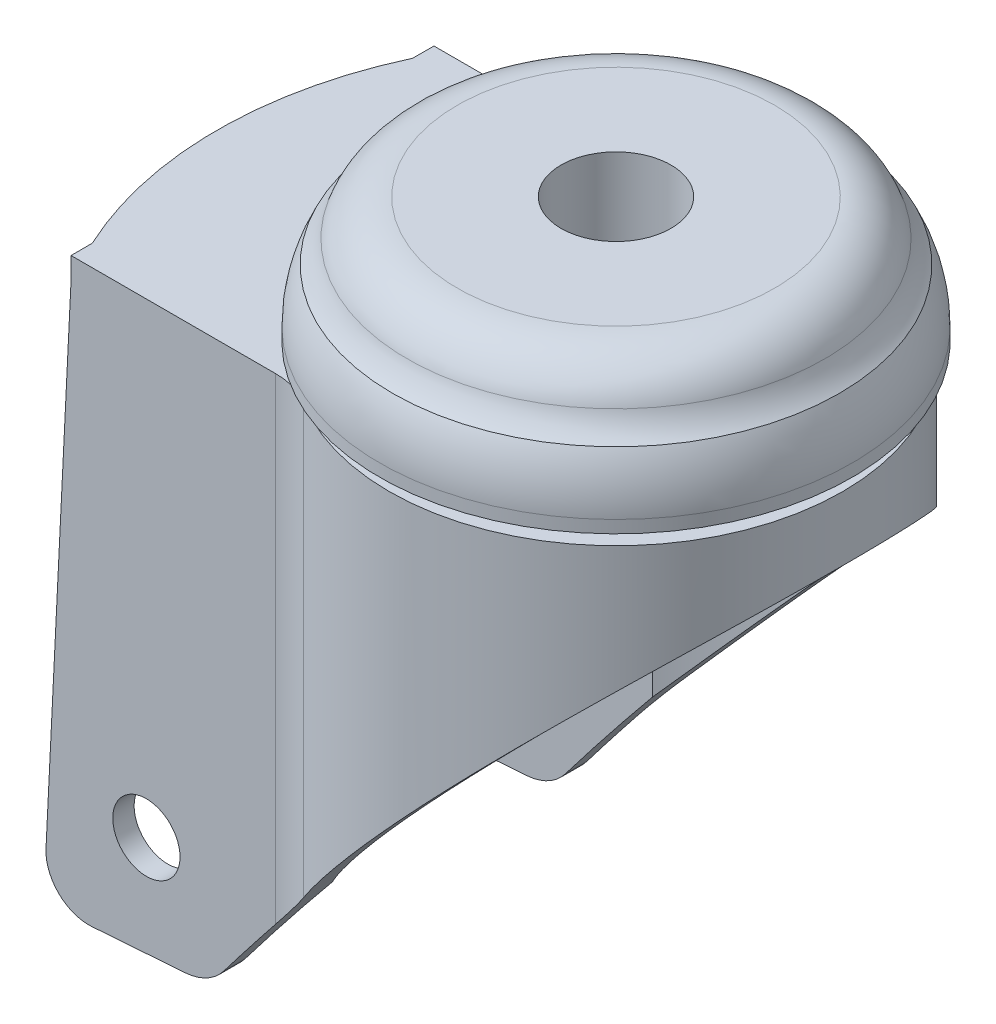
ISO-10303-21;
HEADER;
FILE_DESCRIPTION(('STEP AP214'),'2;1');
FILE_NAME('part.step','',(''),(''),'','','');
FILE_SCHEMA(('AUTOMOTIVE_DESIGN { 1 0 10303 214 1 1 1 1 }'));
ENDSEC;
DATA;
#1=APPLICATION_CONTEXT('core data for automotive mechanical design processes');
#2=APPLICATION_PROTOCOL_DEFINITION('international standard','automotive_design',2000,#1);
#3=PRODUCT_CONTEXT('',#1,'mechanical');
#4=PRODUCT('Part','Part','',(#3));
#5=PRODUCT_RELATED_PRODUCT_CATEGORY('part','',(#4));
#6=PRODUCT_DEFINITION_FORMATION('','',#4);
#7=PRODUCT_DEFINITION_CONTEXT('part definition',#1,'design');
#8=PRODUCT_DEFINITION('design','',#6,#7);
#9=PRODUCT_DEFINITION_SHAPE('','',#8);
#10=(LENGTH_UNIT() NAMED_UNIT(*) SI_UNIT(.MILLI.,.METRE.));
#11=(NAMED_UNIT(*) PLANE_ANGLE_UNIT() SI_UNIT($,.RADIAN.));
#12=(NAMED_UNIT(*) SI_UNIT($,.STERADIAN.) SOLID_ANGLE_UNIT());
#13=UNCERTAINTY_MEASURE_WITH_UNIT(LENGTH_MEASURE(1.E-05),#10,'distance_accuracy_value','');
#14=(GEOMETRIC_REPRESENTATION_CONTEXT(3) GLOBAL_UNCERTAINTY_ASSIGNED_CONTEXT((#13)) GLOBAL_UNIT_ASSIGNED_CONTEXT((#10,
#11,#12)) REPRESENTATION_CONTEXT('',''));
#15=CARTESIAN_POINT('',(0.,0.,0.));
#16=DIRECTION('',(0.,0.,1.));
#17=DIRECTION('',(1.,0.,0.));
#18=AXIS2_PLACEMENT_3D('',#15,#16,#17);
#19=CARTESIAN_POINT('',(-40.,-13.3,-14.99999910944));
#20=DIRECTION('',(0.,0.,1.));
#21=DIRECTION('',(1.,0.,0.));
#22=AXIS2_PLACEMENT_3D('',#19,#20,#21);
#23=PLANE('',#22);
#24=CARTESIAN_POINT('',(-27.,-57.,-14.99999910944));
#25=DIRECTION('',(0.,0.,1.));
#26=DIRECTION('',(1.,0.,0.));
#27=AXIS2_PLACEMENT_3D('',#24,#25,#26);
#28=CIRCLE('',#27,3.14999999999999);
#29=CARTESIAN_POINT('',(-23.85,-57.,-14.99999910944));
#30=VERTEX_POINT('',#29);
#31=EDGE_CURVE('E854',#30,#30,#28,.T.);
#32=ORIENTED_EDGE('',*,*,#31,.F.);
#33=EDGE_LOOP('',(#32));
#34=FACE_BOUND('',#33,.T.);
#35=DIRECTION('',(0.997458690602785,0.0712471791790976,0.));
#36=VECTOR('',#35,1.);
#37=CARTESIAN_POINT('',(-32.12583572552,-66.78005369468,-14.99999910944));
#38=LINE('',#37,#36);
#39=CARTESIAN_POINT('',(-32.1258357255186,-66.7800536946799,-14.99999910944));
#40=VERTEX_POINT('',#39);
#41=CARTESIAN_POINT('',(-23.3615379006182,-66.1540312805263,-14.99999910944));
#42=VERTEX_POINT('',#41);
#43=EDGE_CURVE('E442',#40,#42,#38,.T.);
#44=ORIENTED_EDGE('',*,*,#43,.T.);
#45=CARTESIAN_POINT('',(-23.7177737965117,-61.1667378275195,-14.99999910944));
#46=DIRECTION('',(0.,0.,1.));
#47=DIRECTION('',(1.,0.,0.));
#48=AXIS2_PLACEMENT_3D('',#45,#46,#47);
#49=CIRCLE('',#48,4.999999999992);
#50=CARTESIAN_POINT('',(-19.738098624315,-64.1936480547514,-14.99999910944));
#51=VERTEX_POINT('',#50);
#52=EDGE_CURVE('E806',#42,#51,#49,.T.);
#53=ORIENTED_EDGE('',*,*,#52,.T.);
#54=CARTESIAN_POINT('',(250.0600000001,-269.4000000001,-14.99999910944));
#55=DIRECTION('',(0.,0.,1.));
#56=DIRECTION('',(1.,0.,0.));
#57=AXIS2_PLACEMENT_3D('',#54,#55,#56);
#58=CIRCLE('',#57,338.9700000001);
#59=CARTESIAN_POINT('',(-11.5802645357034,-53.8889031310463,-14.9999991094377));
#60=VERTEX_POINT('',#59);
#61=EDGE_CURVE('E413',#51,#60,#58,.F.);
#62=ORIENTED_EDGE('',*,*,#61,.T.);
#63=DIRECTION('',(0.,1.,0.));
#64=VECTOR('',#63,1.);
#65=CARTESIAN_POINT('',(-11.5802645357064,-13.3,-14.9999991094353));
#66=LINE('',#65,#64);
#67=CARTESIAN_POINT('',(-11.5802645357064,-21.4306218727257,-14.9999991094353));
#68=VERTEX_POINT('',#67);
#69=EDGE_CURVE('E353',#60,#68,#66,.T.);
#70=ORIENTED_EDGE('',*,*,#69,.T.);
#71=DIRECTION('',(1.,0.,0.));
#72=VECTOR('',#71,1.);
#73=CARTESIAN_POINT('',(-40.,-21.4306218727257,-14.99999910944));
#74=LINE('',#73,#72);
#75=CARTESIAN_POINT('',(-11.66270520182,-21.4306218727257,-14.99999910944));
#76=VERTEX_POINT('',#75);
#77=EDGE_CURVE('E222',#68,#76,#74,.F.);
#78=ORIENTED_EDGE('',*,*,#77,.T.);
#79=CARTESIAN_POINT('',(-11.66270520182,-16.30849200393,-14.99999910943));
#80=DIRECTION('',(0.,-1.,0.));
#81=VECTOR('',#80,1.);
#82=LINE('',#79,#81);
#83=CARTESIAN_POINT('',(-11.6627052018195,-16.30849200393,-14.9999991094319));
#84=VERTEX_POINT('',#83);
#85=EDGE_CURVE('E349',#76,#84,#82,.F.);
#86=ORIENTED_EDGE('',*,*,#85,.T.);
#87=DIRECTION('',(0.,-1.,0.));
#88=VECTOR('',#87,1.);
#89=CARTESIAN_POINT('',(-11.662705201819,0.8154246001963,-14.9999991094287));
#90=LINE('',#89,#88);
#91=CARTESIAN_POINT('',(-11.66270520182,-15.3,-14.99999910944));
#92=VERTEX_POINT('',#91);
#93=EDGE_CURVE('E359',#92,#84,#90,.T.);
#94=ORIENTED_EDGE('',*,*,#93,.F.);
#95=DIRECTION('',(1.,0.,0.));
#96=VECTOR('',#95,1.);
#97=CARTESIAN_POINT('',(-40.,-15.3,-14.99999910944));
#98=LINE('',#97,#96);
#99=CARTESIAN_POINT('',(-34.0601738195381,-15.3000105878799,-15.0026742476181));
#100=VERTEX_POINT('',#99);
#101=EDGE_CURVE('E441',#92,#100,#98,.F.);
#102=ORIENTED_EDGE('',*,*,#101,.T.);
#103=DIRECTION('',(-0.0496063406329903,-0.998768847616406,0.));
#104=VECTOR('',#103,1.);
#105=CARTESIAN_POINT('',(-36.4058998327,-62.59179356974,-14.99999910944));
#106=LINE('',#105,#104);
#107=CARTESIAN_POINT('',(-36.4058998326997,-62.5917935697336,-14.99999910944));
#108=VERTEX_POINT('',#107);
#109=EDGE_CURVE('E718',#100,#108,#106,.T.);
#110=ORIENTED_EDGE('',*,*,#109,.T.);
#111=CARTESIAN_POINT('',(-32.4108244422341,-62.7902189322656,-14.99999910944));
#112=DIRECTION('',(0.,0.,1.));
#113=DIRECTION('',(1.,0.,0.));
#114=AXIS2_PLACEMENT_3D('',#111,#112,#113);
#115=CIRCLE('',#114,4.);
#116=EDGE_CURVE('E779',#108,#40,#115,.T.);
#117=ORIENTED_EDGE('',*,*,#116,.T.);
#118=EDGE_LOOP('',(#44,#53,#62,#70,#78,#86,#94,#102,#110,#117));
#119=FACE_BOUND('',#118,.T.);
#120=ADVANCED_FACE('F46',(#34,#119),#23,.T.);
#121=CARTESIAN_POINT('',(0.,-13.3,0.));
#122=DIRECTION('',(0.,1.,0.));
#123=DIRECTION('',(0.,0.,1.));
#124=AXIS2_PLACEMENT_3D('',#121,#122,#123);
#125=CYLINDRICAL_SURFACE('',#124,18.95);
#126=DIRECTION('',(0.,1.,0.));
#127=VECTOR('',#126,1.);
#128=CARTESIAN_POINT('',(-11.58026453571,-13.3,14.99999910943));
#129=LINE('',#128,#127);
#130=CARTESIAN_POINT('',(-11.58026453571,-21.4306218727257,14.99999910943));
#131=VERTEX_POINT('',#130);
#132=CARTESIAN_POINT('',(-11.5802645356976,-53.8889031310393,14.9999991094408));
#133=VERTEX_POINT('',#132);
#134=EDGE_CURVE('E440',#131,#133,#129,.F.);
#135=ORIENTED_EDGE('',*,*,#134,.F.);
#136=CARTESIAN_POINT('',(0.,-21.4306218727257,0.));
#137=DIRECTION('',(0.,1.,0.));
#138=DIRECTION('',(0.,0.,1.));
#139=AXIS2_PLACEMENT_3D('',#136,#137,#138);
#140=CIRCLE('',#139,18.95);
#141=CARTESIAN_POINT('',(18.9499647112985,-21.4306218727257,0.0365710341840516));
#142=VERTEX_POINT('',#141);
#143=EDGE_CURVE('E337',#142,#131,#140,.F.);
#144=ORIENTED_EDGE('',*,*,#143,.F.);
#145=CARTESIAN_POINT('',(-11.5802645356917,-53.888903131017,-14.9999991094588));
#146=CARTESIAN_POINT('',(-11.2757011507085,-53.5191431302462,-15.2350845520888));
#147=CARTESIAN_POINT('',(-10.9668375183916,-53.1457718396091,-15.4587731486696));
#148=CARTESIAN_POINT('',(-10.3414066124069,-52.3930715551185,-15.8839888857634));
#149=CARTESIAN_POINT('',(-10.0248411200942,-52.013743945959,-16.0855210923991));
#150=CARTESIAN_POINT('',(-9.38502690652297,-51.2505401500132,-16.4670060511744));
#151=CARTESIAN_POINT('',(-9.06178391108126,-50.8666679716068,-16.6469764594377));
#152=CARTESIAN_POINT('',(-8.40904609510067,-50.0950327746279,-16.9860445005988));
#153=CARTESIAN_POINT('',(-8.07955076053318,-49.7072694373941,-17.1451404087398));
#154=CARTESIAN_POINT('',(-7.08141501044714,-48.5380433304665,-17.5922874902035));
#155=CARTESIAN_POINT('',(-6.40419549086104,-47.751922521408,-17.8495649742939));
#156=CARTESIAN_POINT('',(-5.03146168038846,-46.1734285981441,-18.2840169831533));
#157=CARTESIAN_POINT('',(-4.33594235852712,-45.3810538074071,-18.4611692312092));
#158=CARTESIAN_POINT('',(-2.91597102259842,-43.778661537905,-18.7385615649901));
#159=CARTESIAN_POINT('',(-2.19121811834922,-42.9686195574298,-18.837127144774));
#160=CARTESIAN_POINT('',(-0.7309928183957,-41.3523626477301,-18.9500490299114));
#161=CARTESIAN_POINT('',(0.0044791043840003,-40.546147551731,-18.9644090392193));
#162=CARTESIAN_POINT('',(1.48146947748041,-38.9427091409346,-18.9064499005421));
#163=CARTESIAN_POINT('',(2.22298633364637,-38.1454835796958,-18.834152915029));
#164=CARTESIAN_POINT('',(3.70686965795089,-36.5653599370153,-18.5990784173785));
#165=CARTESIAN_POINT('',(4.44923584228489,-35.7824580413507,-18.4363253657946));
#166=CARTESIAN_POINT('',(5.74423160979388,-34.4295496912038,-18.0676453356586));
#167=CARTESIAN_POINT('',(6.29811956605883,-33.8550322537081,-17.8825309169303));
#168=CARTESIAN_POINT('',(7.3993127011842,-32.7207316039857,-17.4556969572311));
#169=CARTESIAN_POINT('',(7.94661804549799,-32.1609480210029,-17.2139788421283));
#170=CARTESIAN_POINT('',(9.02964785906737,-31.0606927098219,-16.6713630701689));
#171=CARTESIAN_POINT('',(9.56538712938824,-30.5201956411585,-16.3705467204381));
#172=CARTESIAN_POINT('',(10.6207529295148,-29.4623718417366,-15.7063881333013));
#173=CARTESIAN_POINT('',(11.1403842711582,-28.9450381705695,-15.3430647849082));
#174=CARTESIAN_POINT('',(12.0228167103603,-28.0719290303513,-14.6553527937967));
#175=CARTESIAN_POINT('',(12.3908200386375,-27.7095437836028,-14.3459877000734));
#176=CARTESIAN_POINT('',(13.1114355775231,-27.0030257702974,-13.6905056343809));
#177=CARTESIAN_POINT('',(13.4640485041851,-26.6588921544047,-13.3443903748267));
#178=CARTESIAN_POINT('',(14.149835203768,-25.9923511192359,-12.614874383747));
#179=CARTESIAN_POINT('',(14.483027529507,-25.6699229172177,-12.231510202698));
#180=CARTESIAN_POINT('',(15.1260163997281,-25.0500797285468,-11.4267762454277));
#181=CARTESIAN_POINT('',(15.4358182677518,-24.7526590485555,-11.0054151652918));
#182=CARTESIAN_POINT('',(15.9630664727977,-24.2482316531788,-10.2203525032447));
#183=CARTESIAN_POINT('',(16.1859827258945,-24.0355947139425,-9.8639295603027));
#184=CARTESIAN_POINT('',(16.6118440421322,-23.6303808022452,-9.12850470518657));
#185=CARTESIAN_POINT('',(16.814793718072,-23.4377991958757,-8.74950804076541));
#186=CARTESIAN_POINT('',(17.1979799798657,-23.0749907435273,-7.96997835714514));
#187=CARTESIAN_POINT('',(17.378220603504,-22.9047599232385,-7.56944918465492));
#188=CARTESIAN_POINT('',(17.7132121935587,-22.5889708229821,-6.74841882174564));
#189=CARTESIAN_POINT('',(17.8679627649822,-22.4434129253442,-6.32791732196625));
#190=CARTESIAN_POINT('',(18.1504685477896,-22.1780995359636,-5.46541221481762));
#191=CARTESIAN_POINT('',(18.2779679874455,-22.0585883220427,-5.02324901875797));
#192=CARTESIAN_POINT('',(18.5015815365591,-21.8492309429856,-4.12414059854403));
#193=CARTESIAN_POINT('',(18.5976952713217,-21.7593851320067,-3.66719519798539));
#194=CARTESIAN_POINT('',(18.7563101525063,-21.6112275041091,-2.74281876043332));
#195=CARTESIAN_POINT('',(18.8188371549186,-21.5528914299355,-2.27539607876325));
#196=CARTESIAN_POINT('',(18.9088724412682,-21.4689188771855,-1.33430316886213));
#197=CARTESIAN_POINT('',(18.936386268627,-21.4432772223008,-0.86063394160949));
#198=CARTESIAN_POINT('',(18.9543590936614,-21.4265262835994,0.0204320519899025));
#199=CARTESIAN_POINT('',(18.9495364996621,-21.4310198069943,0.427661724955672));
#200=CARTESIAN_POINT('',(18.9137586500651,-21.4643699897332,1.23993547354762));
#201=CARTESIAN_POINT('',(18.8828063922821,-21.4932238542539,1.64497979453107));
#202=CARTESIAN_POINT('',(18.7953410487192,-21.5748157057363,2.44979802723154));
#203=CARTESIAN_POINT('',(18.7388309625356,-21.627550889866,2.84957255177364));
#204=CARTESIAN_POINT('',(18.6012438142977,-21.7560743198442,3.64109888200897));
#205=CARTESIAN_POINT('',(18.5201660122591,-21.8318632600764,4.03285044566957));
#206=CARTESIAN_POINT('',(18.3372612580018,-22.0030548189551,4.79552231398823));
#207=CARTESIAN_POINT('',(18.2360447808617,-22.0978809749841,5.16671954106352));
#208=CARTESIAN_POINT('',(18.0130888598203,-22.307071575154,5.8971997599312));
#209=CARTESIAN_POINT('',(17.8913505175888,-22.4214349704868,6.25648339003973));
#210=CARTESIAN_POINT('',(17.6289266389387,-22.6683857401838,6.96168254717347));
#211=CARTESIAN_POINT('',(17.4882370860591,-22.8009769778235,7.30759522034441));
#212=CARTESIAN_POINT('',(17.1895906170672,-23.0829775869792,7.98482989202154));
#213=CARTESIAN_POINT('',(17.0316303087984,-23.2323902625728,8.31614900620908));
#214=CARTESIAN_POINT('',(16.6345904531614,-23.6087461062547,9.09121047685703));
#215=CARTESIAN_POINT('',(16.3881191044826,-23.8429974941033,9.52765042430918));
#216=CARTESIAN_POINT('',(15.869182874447,-24.3378636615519,10.3689942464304));
#217=CARTESIAN_POINT('',(15.5967100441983,-24.598486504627,10.773888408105));
#218=CARTESIAN_POINT('',(15.0293907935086,-25.1431097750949,11.5521490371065));
#219=CARTESIAN_POINT('',(14.7345098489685,-25.4271463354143,11.9254649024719));
#220=CARTESIAN_POINT('',(14.1263985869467,-26.0151695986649,12.6399165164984));
#221=CARTESIAN_POINT('',(13.8131675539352,-26.3191570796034,12.981051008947));
#222=CARTESIAN_POINT('',(13.0556954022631,-27.0572848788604,13.749107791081));
#223=CARTESIAN_POINT('',(12.6049643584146,-27.498809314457,14.1625692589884));
#224=CARTESIAN_POINT('',(11.682151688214,-28.4081278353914,14.9328942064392));
#225=CARTESIAN_POINT('',(11.2100628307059,-28.875930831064,15.2897383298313));
#226=CARTESIAN_POINT('',(10.2496776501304,-29.8334531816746,15.9494924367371));
#227=CARTESIAN_POINT('',(9.76136580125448,-30.3231936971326,16.2523488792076));
#228=CARTESIAN_POINT('',(8.77354525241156,-31.3201803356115,16.8061912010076));
#229=CARTESIAN_POINT('',(8.27403640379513,-31.8274266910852,17.0571763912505));
#230=CARTESIAN_POINT('',(7.08249327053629,-33.0452680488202,17.5929053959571));
#231=CARTESIAN_POINT('',(6.38714312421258,-33.7621107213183,17.8561795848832));
#232=CARTESIAN_POINT('',(4.98978085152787,-35.2157428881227,18.2959379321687));
#233=CARTESIAN_POINT('',(4.28776638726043,-35.9525395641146,18.4723903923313));
#234=CARTESIAN_POINT('',(2.88202700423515,-37.4414684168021,18.7432523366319));
#235=CARTESIAN_POINT('',(2.1783011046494,-38.1936221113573,18.8375372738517));
#236=CARTESIAN_POINT('',(0.775082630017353,-39.707257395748,18.947215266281));
#237=CARTESIAN_POINT('',(0.0755895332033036,-40.4687377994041,18.9626182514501));
#238=CARTESIAN_POINT('',(-1.33085024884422,-42.0139470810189,18.9165919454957));
#239=CARTESIAN_POINT('',(-2.03761206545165,-42.7977918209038,18.8534311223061));
#240=CARTESIAN_POINT('',(-3.43886834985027,-44.3664671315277,18.6488109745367));
#241=CARTESIAN_POINT('',(-4.133360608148,-45.1512978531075,18.5073376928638));
#242=CARTESIAN_POINT('',(-5.50444709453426,-46.7151264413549,18.1467571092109));
#243=CARTESIAN_POINT('',(-6.18108259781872,-47.4941340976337,17.9278495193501));
#244=CARTESIAN_POINT('',(-7.51408190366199,-49.0427990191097,17.4112572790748));
#245=CARTESIAN_POINT('',(-8.17045574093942,-49.8124607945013,17.1136123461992));
#246=CARTESIAN_POINT('',(-9.29053271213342,-51.13752900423,16.5250564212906));
#247=CARTESIAN_POINT('',(-9.75982455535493,-51.6964440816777,16.2526493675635));
#248=CARTESIAN_POINT('',(-10.451857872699,-52.5259294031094,15.8093693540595));
#249=CARTESIAN_POINT('',(-10.6805179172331,-52.8009024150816,15.6558569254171));
#250=CARTESIAN_POINT('',(-11.1336378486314,-53.3475280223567,15.3369262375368));
#251=CARTESIAN_POINT('',(-11.3580965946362,-53.619179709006,15.1715048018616));
#252=CARTESIAN_POINT('',(-11.5802645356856,-53.8889031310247,14.9999991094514));
#253=B_SPLINE_CURVE_WITH_KNOTS('',3,(#145,#146,#147,#148,#149,#150,#151,#152,#153,#154,#155,
#156,#157,#158,#159,#160,#161,#162,#163,#164,#165,#166,#167,#168,#169,#170,#171,#172,#173,#174,
#175,#176,#177,#178,#179,#180,#181,#182,#183,#184,#185,#186,#187,#188,#189,#190,#191,#192,#193,
#194,#195,#196,#197,#198,#199,#200,#201,#202,#203,#204,#205,#206,#207,#208,#209,#210,#211,#212,
#213,#214,#215,#216,#217,#218,#219,#220,#221,#222,#223,#224,#225,#226,#227,#228,#229,#230,#231,
#232,#233,#234,#235,#236,#237,#238,#239,#240,#241,#242,#243,#244,#245,#246,#247,#248,#249,#250,
#251,#252),.UNSPECIFIED.,.F.,.F.,(4,2,2,2,2,2,2,2,2,2,2,2,2,2,2,2,2,2,2,2,2,2,2,2,2,2,2,2,2,2,2,
2,2,2,2,2,2,2,2,2,2,2,2,2,2,2,2,2,2,2,2,2,2,4),(0.,1.60060234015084,3.20083793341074,
4.79975406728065,6.39880222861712,9.60223282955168,12.8065535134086,16.0774514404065,
19.3482054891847,22.6181232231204,25.8871571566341,28.3429544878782,30.798689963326,
33.2510702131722,35.7027106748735,37.5074367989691,39.3120788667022,41.1149676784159,
42.917444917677,44.3295157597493,45.7412596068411,47.1527520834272,48.5642664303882,
49.9884976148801,51.4127458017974,52.8358959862,54.2588208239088,55.4791348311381,
56.6993088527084,57.9193397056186,59.1394073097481,60.3269636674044,61.5144562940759,
62.7022009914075,63.8901793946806,65.5475327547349,67.2053944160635,68.8658642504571,
70.5263988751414,72.7861094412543,75.0465908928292,77.3093018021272,79.5720427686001,
82.6660227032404,85.7611313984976,88.8609234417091,91.9603252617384,95.1292640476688,
98.2987677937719,101.460155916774,104.619952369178,106.955347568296,108.122692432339,
109.290349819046),.UNSPECIFIED.);
#254=EDGE_CURVE('E410',#142,#133,#253,.T.);
#255=ORIENTED_EDGE('',*,*,#254,.T.);
#256=EDGE_LOOP('',(#135,#144,#255));
#257=FACE_BOUND('',#256,.T.);
#258=ADVANCED_FACE('F386',(#257),#125,.F.);
#259=CARTESIAN_POINT('',(-11.58026453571,-13.3,14.99999910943));
#260=DIRECTION('',(0.,0.,-1.));
#261=DIRECTION('',(-1.,0.,0.));
#262=AXIS2_PLACEMENT_3D('',#259,#260,#261);
#263=PLANE('',#262);
#264=CARTESIAN_POINT('',(-27.,-57.,14.99999910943));
#265=DIRECTION('',(0.,0.,-1.));
#266=DIRECTION('',(-1.,0.,0.));
#267=AXIS2_PLACEMENT_3D('',#264,#265,#266);
#268=CIRCLE('',#267,3.15);
#269=CARTESIAN_POINT('',(-30.15,-57.,14.99999910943));
#270=VERTEX_POINT('',#269);
#271=EDGE_CURVE('E860',#270,#270,#268,.T.);
#272=ORIENTED_EDGE('',*,*,#271,.F.);
#273=EDGE_LOOP('',(#272));
#274=FACE_BOUND('',#273,.T.);
#275=CARTESIAN_POINT('',(250.0600000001,-269.4000000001,14.99999910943));
#276=DIRECTION('',(0.,0.,1.));
#277=DIRECTION('',(1.,0.,0.));
#278=AXIS2_PLACEMENT_3D('',#275,#276,#277);
#279=CIRCLE('',#278,338.9700000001);
#280=CARTESIAN_POINT('',(-19.738098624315,-64.1936480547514,14.99999910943));
#281=VERTEX_POINT('',#280);
#282=EDGE_CURVE('E408',#133,#281,#279,.T.);
#283=ORIENTED_EDGE('',*,*,#282,.T.);
#284=CARTESIAN_POINT('',(-23.7177737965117,-61.1667378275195,14.99999910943));
#285=DIRECTION('',(0.,0.,-1.));
#286=DIRECTION('',(-1.,0.,0.));
#287=AXIS2_PLACEMENT_3D('',#284,#285,#286);
#288=CIRCLE('',#287,4.999999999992);
#289=CARTESIAN_POINT('',(-23.3615379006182,-66.1540312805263,14.99999910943));
#290=VERTEX_POINT('',#289);
#291=EDGE_CURVE('E797',#281,#290,#288,.T.);
#292=ORIENTED_EDGE('',*,*,#291,.T.);
#293=DIRECTION('',(-0.997458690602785,-0.0712471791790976,0.));
#294=VECTOR('',#293,1.);
#295=CARTESIAN_POINT('',(-23.36153790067,-66.15403128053,14.99999910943));
#296=LINE('',#295,#294);
#297=CARTESIAN_POINT('',(-32.1258357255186,-66.7800536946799,14.99999910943));
#298=VERTEX_POINT('',#297);
#299=EDGE_CURVE('E540',#290,#298,#296,.T.);
#300=ORIENTED_EDGE('',*,*,#299,.T.);
#301=CARTESIAN_POINT('',(-32.4108244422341,-62.7902189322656,14.99999910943));
#302=DIRECTION('',(0.,0.,-1.));
#303=DIRECTION('',(-1.,0.,0.));
#304=AXIS2_PLACEMENT_3D('',#301,#302,#303);
#305=CIRCLE('',#304,4.);
#306=CARTESIAN_POINT('',(-36.4058998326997,-62.5917935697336,14.99999910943));
#307=VERTEX_POINT('',#306);
#308=EDGE_CURVE('E789',#298,#307,#305,.T.);
#309=ORIENTED_EDGE('',*,*,#308,.T.);
#310=DIRECTION('',(0.0496063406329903,0.998768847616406,0.));
#311=VECTOR('',#310,1.);
#312=CARTESIAN_POINT('',(-36.4058998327,-62.59179356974,14.99999910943));
#313=LINE('',#312,#311);
#314=CARTESIAN_POINT('',(-34.0602239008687,-15.3000107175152,15.0024475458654));
#315=VERTEX_POINT('',#314);
#316=EDGE_CURVE('E543',#307,#315,#313,.T.);
#317=ORIENTED_EDGE('',*,*,#316,.T.);
#318=DIRECTION('',(-1.,0.,0.));
#319=VECTOR('',#318,1.);
#320=CARTESIAN_POINT('',(-11.58026453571,-15.3,14.99999910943));
#321=LINE('',#320,#319);
#322=CARTESIAN_POINT('',(-11.662705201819,-15.3,14.9999991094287));
#323=VERTEX_POINT('',#322);
#324=EDGE_CURVE('E562',#315,#323,#321,.F.);
#325=ORIENTED_EDGE('',*,*,#324,.T.);
#326=DIRECTION('',(0.,-1.,0.));
#327=VECTOR('',#326,1.);
#328=CARTESIAN_POINT('',(-11.662705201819,0.8154246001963,14.9999991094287));
#329=LINE('',#328,#327);
#330=CARTESIAN_POINT('',(-11.6627052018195,-16.30849200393,14.9999991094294));
#331=VERTEX_POINT('',#330);
#332=EDGE_CURVE('E361',#331,#323,#329,.F.);
#333=ORIENTED_EDGE('',*,*,#332,.F.);
#334=CARTESIAN_POINT('',(-11.66270520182,-21.4306218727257,14.99999910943));
#335=DIRECTION('',(0.,1.,0.));
#336=VECTOR('',#335,1.);
#337=LINE('',#334,#336);
#338=CARTESIAN_POINT('',(-11.66270520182,-21.4306218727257,14.99999910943));
#339=VERTEX_POINT('',#338);
#340=EDGE_CURVE('E333',#339,#331,#337,.T.);
#341=ORIENTED_EDGE('',*,*,#340,.F.);
#342=DIRECTION('',(1.,0.,0.));
#343=VECTOR('',#342,1.);
#344=CARTESIAN_POINT('',(0.,-21.4306218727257,14.99999910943));
#345=LINE('',#344,#343);
#346=EDGE_CURVE('E330',#131,#339,#345,.F.);
#347=ORIENTED_EDGE('',*,*,#346,.F.);
#348=ORIENTED_EDGE('',*,*,#134,.T.);
#349=EDGE_LOOP('',(#283,#292,#300,#309,#317,#325,#333,#341,#347,#348));
#350=FACE_BOUND('',#349,.T.);
#351=ADVANCED_FACE('F366',(#274,#350),#263,.T.);
#352=CARTESIAN_POINT('',(-40.,-13.3,17.));
#353=DIRECTION('',(0.,0.,1.));
#354=DIRECTION('',(1.,0.,0.));
#355=AXIS2_PLACEMENT_3D('',#352,#353,#354);
#356=PLANE('',#355);
#357=CARTESIAN_POINT('',(-27.,-57.,17.));
#358=DIRECTION('',(0.,0.,1.));
#359=DIRECTION('',(1.,0.,0.));
#360=AXIS2_PLACEMENT_3D('',#357,#358,#359);
#361=CIRCLE('',#360,3.14999999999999);
#362=CARTESIAN_POINT('',(-23.85,-57.,17.));
#363=VERTEX_POINT('',#362);
#364=EDGE_CURVE('E856',#363,#363,#361,.T.);
#365=ORIENTED_EDGE('',*,*,#364,.F.);
#366=EDGE_LOOP('',(#365));
#367=FACE_BOUND('',#366,.T.);
#368=CARTESIAN_POINT('',(250.0600000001,-269.4000000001,17.));
#369=DIRECTION('',(0.,0.,1.));
#370=DIRECTION('',(1.,0.,0.));
#371=AXIS2_PLACEMENT_3D('',#368,#369,#370);
#372=CIRCLE('',#371,338.9700000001);
#373=CARTESIAN_POINT('',(-19.738098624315,-64.1936480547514,17.));
#374=VERTEX_POINT('',#373);
#375=CARTESIAN_POINT('',(-14.9017616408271,-57.9858903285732,17.));
#376=VERTEX_POINT('',#375);
#377=EDGE_CURVE('E616',#374,#376,#372,.F.);
#378=ORIENTED_EDGE('',*,*,#377,.T.);
#379=DIRECTION('',(0.,-1.,0.));
#380=VECTOR('',#379,1.);
#381=CARTESIAN_POINT('',(-14.9017616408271,-13.3,17.));
#382=LINE('',#381,#380);
#383=CARTESIAN_POINT('',(-14.9017616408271,-13.3,17.));
#384=VERTEX_POINT('',#383);
#385=EDGE_CURVE('E62',#376,#384,#382,.F.);
#386=ORIENTED_EDGE('',*,*,#385,.T.);
#387=DIRECTION('',(1.,0.,0.));
#388=VECTOR('',#387,1.);
#389=CARTESIAN_POINT('',(-12.75,-13.3,17.));
#390=LINE('',#389,#388);
#391=CARTESIAN_POINT('',(-34.05703520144,-13.3,17.));
#392=VERTEX_POINT('',#391);
#393=EDGE_CURVE('E205',#392,#384,#390,.T.);
#394=ORIENTED_EDGE('',*,*,#393,.F.);
#395=DIRECTION('',(0.,-1.,0.));
#396=VECTOR('',#395,1.);
#397=CARTESIAN_POINT('',(-34.05703520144,-13.3,17.));
#398=LINE('',#397,#396);
#399=CARTESIAN_POINT('',(-34.05703520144,-15.3,17.));
#400=VERTEX_POINT('',#399);
#401=EDGE_CURVE('E203',#392,#400,#398,.T.);
#402=ORIENTED_EDGE('',*,*,#401,.T.);
#403=DIRECTION('',(-0.0496063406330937,-0.998768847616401,0.));
#404=VECTOR('',#403,1.);
#405=CARTESIAN_POINT('',(-34.05703520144,-15.3,17.));
#406=LINE('',#405,#404);
#407=CARTESIAN_POINT('',(-36.4058998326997,-62.5917935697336,17.));
#408=VERTEX_POINT('',#407);
#409=EDGE_CURVE('E525',#400,#408,#406,.T.);
#410=ORIENTED_EDGE('',*,*,#409,.T.);
#411=CARTESIAN_POINT('',(-32.4108244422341,-62.7902189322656,17.));
#412=DIRECTION('',(0.,0.,1.));
#413=DIRECTION('',(1.,0.,0.));
#414=AXIS2_PLACEMENT_3D('',#411,#412,#413);
#415=CIRCLE('',#414,4.);
#416=CARTESIAN_POINT('',(-32.1258357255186,-66.7800536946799,17.));
#417=VERTEX_POINT('',#416);
#418=EDGE_CURVE('E784',#408,#417,#415,.T.);
#419=ORIENTED_EDGE('',*,*,#418,.T.);
#420=DIRECTION('',(0.997458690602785,0.0712471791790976,0.));
#421=VECTOR('',#420,1.);
#422=CARTESIAN_POINT('',(-32.12583572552,-66.78005369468,17.));
#423=LINE('',#422,#421);
#424=CARTESIAN_POINT('',(-23.3615379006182,-66.1540312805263,17.));
#425=VERTEX_POINT('',#424);
#426=EDGE_CURVE('E555',#417,#425,#423,.T.);
#427=ORIENTED_EDGE('',*,*,#426,.T.);
#428=CARTESIAN_POINT('',(-23.7177737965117,-61.1667378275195,17.));
#429=DIRECTION('',(0.,0.,1.));
#430=DIRECTION('',(1.,0.,0.));
#431=AXIS2_PLACEMENT_3D('',#428,#429,#430);
#432=CIRCLE('',#431,4.999999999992);
#433=EDGE_CURVE('E801',#425,#374,#432,.T.);
#434=ORIENTED_EDGE('',*,*,#433,.T.);
#435=EDGE_LOOP('',(#378,#386,#394,#402,#410,#419,#427,#434));
#436=FACE_BOUND('',#435,.T.);
#437=ADVANCED_FACE('F385',(#367,#436),#356,.T.);
#438=CARTESIAN_POINT('',(-14.90176164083,-13.3,-17.));
#439=DIRECTION('',(0.,0.,-1.));
#440=DIRECTION('',(-1.,0.,0.));
#441=AXIS2_PLACEMENT_3D('',#438,#439,#440);
#442=PLANE('',#441);
#443=CARTESIAN_POINT('',(-27.,-57.,-17.));
#444=DIRECTION('',(0.,0.,-1.));
#445=DIRECTION('',(-1.,0.,0.));
#446=AXIS2_PLACEMENT_3D('',#443,#444,#445);
#447=CIRCLE('',#446,3.14999999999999);
#448=CARTESIAN_POINT('',(-30.15,-57.,-17.));
#449=VERTEX_POINT('',#448);
#450=EDGE_CURVE('E857',#449,#449,#447,.T.);
#451=ORIENTED_EDGE('',*,*,#450,.F.);
#452=EDGE_LOOP('',(#451));
#453=FACE_BOUND('',#452,.T.);
#454=DIRECTION('',(-1.,0.,0.));
#455=VECTOR('',#454,1.);
#456=CARTESIAN_POINT('',(-34.05703520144,-13.3,-17.));
#457=LINE('',#456,#455);
#458=CARTESIAN_POINT('',(-14.9017616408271,-13.3,-17.));
#459=VERTEX_POINT('',#458);
#460=CARTESIAN_POINT('',(-34.05703520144,-13.3,-17.));
#461=VERTEX_POINT('',#460);
#462=EDGE_CURVE('E896',#459,#461,#457,.T.);
#463=ORIENTED_EDGE('',*,*,#462,.F.);
#464=DIRECTION('',(0.,-1.,0.));
#465=VECTOR('',#464,1.);
#466=CARTESIAN_POINT('',(-14.9017616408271,-55.3169207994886,-17.));
#467=LINE('',#466,#465);
#468=CARTESIAN_POINT('',(-14.9017616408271,-57.9858903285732,-17.));
#469=VERTEX_POINT('',#468);
#470=EDGE_CURVE('E810',#459,#469,#467,.T.);
#471=ORIENTED_EDGE('',*,*,#470,.T.);
#472=CARTESIAN_POINT('',(250.0600000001,-269.4000000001,-17.));
#473=DIRECTION('',(0.,0.,1.));
#474=DIRECTION('',(1.,0.,0.));
#475=AXIS2_PLACEMENT_3D('',#472,#473,#474);
#476=CIRCLE('',#475,338.9700000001);
#477=CARTESIAN_POINT('',(-19.738098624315,-64.1936480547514,-17.));
#478=VERTEX_POINT('',#477);
#479=EDGE_CURVE('E612',#469,#478,#476,.T.);
#480=ORIENTED_EDGE('',*,*,#479,.T.);
#481=CARTESIAN_POINT('',(-23.7177737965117,-61.1667378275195,-17.));
#482=DIRECTION('',(0.,0.,-1.));
#483=DIRECTION('',(-1.,0.,0.));
#484=AXIS2_PLACEMENT_3D('',#481,#482,#483);
#485=CIRCLE('',#484,4.999999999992);
#486=CARTESIAN_POINT('',(-23.3615379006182,-66.1540312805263,-17.));
#487=VERTEX_POINT('',#486);
#488=EDGE_CURVE('E808',#478,#487,#485,.T.);
#489=ORIENTED_EDGE('',*,*,#488,.T.);
#490=DIRECTION('',(-0.997458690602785,-0.0712471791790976,0.));
#491=VECTOR('',#490,1.);
#492=CARTESIAN_POINT('',(-23.36153790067,-66.15403128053,-17.));
#493=LINE('',#492,#491);
#494=CARTESIAN_POINT('',(-32.1258357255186,-66.7800536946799,-17.));
#495=VERTEX_POINT('',#494);
#496=EDGE_CURVE('E560',#487,#495,#493,.T.);
#497=ORIENTED_EDGE('',*,*,#496,.T.);
#498=CARTESIAN_POINT('',(-32.4108244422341,-62.7902189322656,-17.));
#499=DIRECTION('',(0.,0.,-1.));
#500=DIRECTION('',(-1.,0.,0.));
#501=AXIS2_PLACEMENT_3D('',#498,#499,#500);
#502=CIRCLE('',#501,4.);
#503=CARTESIAN_POINT('',(-36.4058998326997,-62.5917935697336,-17.));
#504=VERTEX_POINT('',#503);
#505=EDGE_CURVE('E1005',#495,#504,#502,.T.);
#506=ORIENTED_EDGE('',*,*,#505,.T.);
#507=DIRECTION('',(0.0496063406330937,0.998768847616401,0.));
#508=VECTOR('',#507,1.);
#509=CARTESIAN_POINT('',(-36.4058998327,-62.59179356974,-17.));
#510=LINE('',#509,#508);
#511=CARTESIAN_POINT('',(-34.05703520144,-15.3,-17.));
#512=VERTEX_POINT('',#511);
#513=EDGE_CURVE('E985',#504,#512,#510,.T.);
#514=ORIENTED_EDGE('',*,*,#513,.T.);
#515=DIRECTION('',(0.,-1.,0.));
#516=VECTOR('',#515,1.);
#517=CARTESIAN_POINT('',(-34.05703520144,-13.3,-17.));
#518=LINE('',#517,#516);
#519=EDGE_CURVE('E223',#461,#512,#518,.T.);
#520=ORIENTED_EDGE('',*,*,#519,.F.);
#521=EDGE_LOOP('',(#463,#471,#480,#489,#497,#506,#514,#520));
#522=FACE_BOUND('',#521,.T.);
#523=ADVANCED_FACE('F929',(#453,#522),#442,.T.);
#524=CARTESIAN_POINT('',(0.,-13.3,0.));
#525=DIRECTION('',(0.,1.,0.));
#526=DIRECTION('',(0.,0.,1.));
#527=AXIS2_PLACEMENT_3D('',#524,#525,#526);
#528=CYLINDRICAL_SURFACE('',#527,21.25);
#529=CARTESIAN_POINT('',(-17.0403371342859,-60.6942961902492,12.6960391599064));
#530=CARTESIAN_POINT('',(-16.8262190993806,-60.4202645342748,12.9833849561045));
#531=CARTESIAN_POINT('',(-16.6073209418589,-60.1409935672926,13.2620521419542));
#532=CARTESIAN_POINT('',(-16.1609260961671,-59.5733829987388,13.8025370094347));
#533=CARTESIAN_POINT('',(-15.9334321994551,-59.2850463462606,14.0643600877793));
#534=CARTESIAN_POINT('',(-15.4710748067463,-58.7010493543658,14.5714032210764));
#535=CARTESIAN_POINT('',(-15.2362249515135,-58.4054027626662,14.8166516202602));
#536=CARTESIAN_POINT('',(-14.7594887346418,-57.8073592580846,15.2916057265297));
#537=CARTESIAN_POINT('',(-14.5176017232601,-57.5049617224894,15.5213099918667));
#538=CARTESIAN_POINT('',(-13.7848582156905,-56.5922047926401,16.1856006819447));
#539=CARTESIAN_POINT('',(-13.2844890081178,-55.9732084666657,16.5980029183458));
#540=CARTESIAN_POINT('',(-12.2622061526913,-54.7179628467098,17.3669255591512));
#541=CARTESIAN_POINT('',(-11.7402783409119,-54.0817023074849,17.7234084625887));
#542=CARTESIAN_POINT('',(-10.8328022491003,-52.9838357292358,18.2868570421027));
#543=CARTESIAN_POINT('',(-10.4517596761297,-52.5252783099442,18.5071467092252));
#544=CARTESIAN_POINT('',(-9.68139698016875,-51.6032404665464,18.9215321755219));
#545=CARTESIAN_POINT('',(-9.29207625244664,-51.1397596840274,19.1156260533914));
#546=CARTESIAN_POINT('',(-8.50598113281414,-50.2090665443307,19.4781448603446));
#547=CARTESIAN_POINT('',(-8.1092064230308,-49.741854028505,19.6465686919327));
#548=CARTESIAN_POINT('',(-7.30893483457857,-48.8047320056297,19.9581143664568));
#549=CARTESIAN_POINT('',(-6.90543727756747,-48.3348222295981,20.1012336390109));
#550=CARTESIAN_POINT('',(-5.68217825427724,-46.9181830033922,20.4941834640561));
#551=CARTESIAN_POINT('',(-4.85311987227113,-45.9686541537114,20.7060152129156));
#552=CARTESIAN_POINT('',(-3.17599567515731,-44.0695828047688,21.0286622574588));
#553=CARTESIAN_POINT('',(-2.32793139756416,-43.1200403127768,21.1394856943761));
#554=CARTESIAN_POINT('',(-0.605605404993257,-41.2134779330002,21.2591524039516));
#555=CARTESIAN_POINT('',(0.268857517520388,-40.2565453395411,21.2665144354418));
#556=CARTESIAN_POINT('',(2.02637550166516,-38.3552920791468,21.17146272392));
#557=CARTESIAN_POINT('',(2.90943227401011,-37.4109740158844,21.0690266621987));
#558=CARTESIAN_POINT('',(4.23294874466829,-36.0116258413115,20.8289382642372));
#559=CARTESIAN_POINT('',(4.67326368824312,-35.5487329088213,20.7347149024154));
#560=CARTESIAN_POINT('',(5.5529651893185,-34.6290987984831,20.5166395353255));
#561=CARTESIAN_POINT('',(5.99235171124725,-34.1723578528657,20.3927864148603));
#562=CARTESIAN_POINT('',(7.30682206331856,-32.8135698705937,19.9754306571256));
#563=CARTESIAN_POINT('',(8.17905713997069,-31.9220695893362,19.6359837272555));
#564=CARTESIAN_POINT('',(9.56606524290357,-30.519508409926,18.9839407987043));
#565=CARTESIAN_POINT('',(10.0875991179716,-29.9956561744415,18.7124898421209));
#566=CARTESIAN_POINT('',(11.1193232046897,-28.96592557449,18.1184271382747));
#567=CARTESIAN_POINT('',(11.6295145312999,-28.4600454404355,17.7958204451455));
#568=CARTESIAN_POINT('',(12.6338231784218,-27.4703235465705,17.0974517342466));
#569=CARTESIAN_POINT('',(13.1279525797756,-26.986465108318,16.7217308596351));
#570=CARTESIAN_POINT('',(14.0953108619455,-26.0447419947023,15.9148119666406));
#571=CARTESIAN_POINT('',(14.5685443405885,-25.5868715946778,15.4836262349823));
#572=CARTESIAN_POINT('',(15.3859168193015,-24.8003629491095,14.6660178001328));
#573=CARTESIAN_POINT('',(15.7354196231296,-24.4655755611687,14.2908581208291));
#574=CARTESIAN_POINT('',(16.4145323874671,-23.8176787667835,13.5053751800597));
#575=CARTESIAN_POINT('',(16.7441433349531,-23.5045682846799,13.0950536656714));
#576=CARTESIAN_POINT('',(17.3793066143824,-22.9034547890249,12.2395109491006));
#577=CARTESIAN_POINT('',(17.6848822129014,-22.6154274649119,11.7943243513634));
#578=CARTESIAN_POINT('',(18.1220650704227,-22.204742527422,11.1008092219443));
#579=CARTESIAN_POINT('',(18.2642575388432,-22.0714116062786,10.8653578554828));
#580=CARTESIAN_POINT('',(18.5410840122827,-21.81226125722,10.385920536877));
#581=CARTESIAN_POINT('',(18.675716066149,-21.686443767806,10.1419324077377));
#582=CARTESIAN_POINT('',(19.01741407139,-21.3676074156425,9.49242162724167));
#583=CARTESIAN_POINT('',(19.2178768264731,-21.1810620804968,9.08017828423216));
#584=CARTESIAN_POINT('',(19.5947323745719,-20.8311212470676,8.235461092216));
#585=CARTESIAN_POINT('',(19.7711301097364,-20.6677209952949,7.80299142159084));
#586=CARTESIAN_POINT('',(20.0973060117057,-20.3661275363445,6.91970538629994));
#587=CARTESIAN_POINT('',(20.247091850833,-20.2279270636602,6.46889435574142));
#588=CARTESIAN_POINT('',(20.5176609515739,-19.9786509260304,5.55129403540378));
#589=CARTESIAN_POINT('',(20.6384438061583,-19.8675756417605,5.08450452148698));
#590=CARTESIAN_POINT('',(20.8494848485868,-19.6737071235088,4.13513670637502));
#591=CARTESIAN_POINT('',(20.9395505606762,-19.5910921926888,3.65247890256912));
#592=CARTESIAN_POINT('',(21.0863540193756,-19.4565257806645,2.67787213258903));
#593=CARTESIAN_POINT('',(21.1430915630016,-19.404574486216,2.18592310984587));
#594=CARTESIAN_POINT('',(21.222048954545,-19.3322972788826,1.19710348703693));
#595=CARTESIAN_POINT('',(21.2442799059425,-19.3119611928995,0.700234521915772));
#596=CARTESIAN_POINT('',(21.2537794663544,-19.3032698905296,-0.294094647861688));
#597=CARTESIAN_POINT('',(21.2410509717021,-19.3149120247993,-0.791554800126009));
#598=CARTESIAN_POINT('',(21.1839582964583,-19.367162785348,-1.73254403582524));
#599=CARTESIAN_POINT('',(21.1429152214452,-19.4047306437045,-2.17645092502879));
#600=CARTESIAN_POINT('',(21.0335087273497,-19.5049566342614,-3.05797959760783));
#601=CARTESIAN_POINT('',(20.965147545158,-19.5676127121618,-3.49560189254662));
#602=CARTESIAN_POINT('',(20.8022184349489,-19.7171157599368,-4.36169656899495));
#603=CARTESIAN_POINT('',(20.7076513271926,-19.8039619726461,-4.79016923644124));
#604=CARTESIAN_POINT('',(20.4937547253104,-20.0006796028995,-5.63547891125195));
#605=CARTESIAN_POINT('',(20.3744240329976,-20.1105521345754,-6.05231535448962));
#606=CARTESIAN_POINT('',(20.1094689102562,-20.3549289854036,-6.88230968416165));
#607=CARTESIAN_POINT('',(19.9632695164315,-20.4899730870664,-7.29512440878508));
#608=CARTESIAN_POINT('',(19.6486372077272,-20.7811939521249,-8.10444849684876));
#609=CARTESIAN_POINT('',(19.4802046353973,-20.9373703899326,-8.50095811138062));
#610=CARTESIAN_POINT('',(19.1230960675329,-21.2692548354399,-9.27642006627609));
#611=CARTESIAN_POINT('',(18.9344140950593,-21.4449686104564,-9.65536717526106));
#612=CARTESIAN_POINT('',(18.53886908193,-21.8142570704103,-10.3946464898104));
#613=CARTESIAN_POINT('',(18.3320023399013,-22.0078353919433,-10.7549748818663));
#614=CARTESIAN_POINT('',(17.8048653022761,-22.502457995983,-11.6148997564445));
#615=CARTESIAN_POINT('',(17.4755964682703,-22.8125315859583,-12.1038386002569));
#616=CARTESIAN_POINT('',(16.7885161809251,-23.4624073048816,-13.0401583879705));
#617=CARTESIAN_POINT('',(16.4306948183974,-23.80221975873,-13.4875247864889));
#618=CARTESIAN_POINT('',(15.6909742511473,-24.5080190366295,-14.3413878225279));
#619=CARTESIAN_POINT('',(15.3090354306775,-24.8740490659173,-14.7478142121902));
#620=CARTESIAN_POINT('',(14.5260781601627,-25.628122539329,-15.5195939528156));
#621=CARTESIAN_POINT('',(14.1250592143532,-26.0161665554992,-15.8849462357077));
#622=CARTESIAN_POINT('',(13.1569562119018,-26.957807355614,-16.7030972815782));
#623=CARTESIAN_POINT('',(12.5831605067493,-27.5196908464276,-17.1384686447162));
#624=CARTESIAN_POINT('',(11.4149795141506,-28.6721678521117,-17.9377237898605));
#625=CARTESIAN_POINT('',(10.8205870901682,-29.2627713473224,-18.3015824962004));
#626=CARTESIAN_POINT('',(9.61722395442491,-30.467670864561,-18.9616148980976));
#627=CARTESIAN_POINT('',(9.00823953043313,-31.0819895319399,-19.2577219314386));
#628=CARTESIAN_POINT('',(7.78155400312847,-32.3291642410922,-19.7852394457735));
#629=CARTESIAN_POINT('',(7.16385286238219,-32.9620203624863,-20.0166496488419));
#630=CARTESIAN_POINT('',(5.71331704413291,-34.460043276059,-20.4861594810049));
#631=CARTESIAN_POINT('',(4.87864636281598,-35.3311311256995,-20.6998537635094));
#632=CARTESIAN_POINT('',(3.20918849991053,-37.0924199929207,-21.0234841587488));
#633=CARTESIAN_POINT('',(2.37440138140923,-37.9826276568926,-21.133383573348));
#634=CARTESIAN_POINT('',(0.710311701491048,-39.7766288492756,-21.2545220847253));
#635=CARTESIAN_POINT('',(-0.118983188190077,-40.6804372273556,-21.2656441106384));
#636=CARTESIAN_POINT('',(-1.76562838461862,-42.4947022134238,-21.1925499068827));
#637=CARTESIAN_POINT('',(-2.58298088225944,-43.4051575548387,-21.1083513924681));
#638=CARTESIAN_POINT('',(-4.07556273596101,-45.0858520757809,-20.866998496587));
#639=CARTESIAN_POINT('',(-4.75316864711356,-45.855931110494,-20.7231890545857));
#640=CARTESIAN_POINT('',(-6.09385179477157,-47.3934571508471,-20.3692938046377));
#641=CARTESIAN_POINT('',(-6.75693027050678,-48.1609043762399,-20.1592136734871));
#642=CARTESIAN_POINT('',(-8.06364682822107,-49.6868922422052,-19.6729404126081));
#643=CARTESIAN_POINT('',(-8.70734069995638,-50.4454536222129,-19.3969626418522));
#644=CARTESIAN_POINT('',(-9.97448391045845,-51.9518534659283,-18.7768428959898));
#645=CARTESIAN_POINT('',(-10.5979314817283,-52.6996909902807,-18.4326949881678));
#646=CARTESIAN_POINT('',(-11.7401190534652,-54.0815074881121,-17.7235008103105));
#647=CARTESIAN_POINT('',(-12.261834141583,-54.717508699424,-17.3671784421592));
#648=CARTESIAN_POINT('',(-13.2838019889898,-55.9723622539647,-16.5985465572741));
#649=CARTESIAN_POINT('',(-13.7840663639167,-56.5912238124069,-16.1862678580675));
#650=CARTESIAN_POINT('',(-14.5168046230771,-57.5039660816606,-15.522058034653));
#651=CARTESIAN_POINT('',(-14.758785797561,-57.8064792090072,-15.2922867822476));
#652=CARTESIAN_POINT('',(-15.2357071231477,-58.4047514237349,-14.8171867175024));
#653=CARTESIAN_POINT('',(-15.4706479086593,-58.7005111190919,-14.5718593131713));
#654=CARTESIAN_POINT('',(-15.9331540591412,-59.2846940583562,-14.0646771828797));
#655=CARTESIAN_POINT('',(-16.1607067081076,-59.5731044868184,-13.802796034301));
#656=CARTESIAN_POINT('',(-16.6072145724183,-60.1408578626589,-13.2621875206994));
#657=CARTESIAN_POINT('',(-16.8261670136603,-60.4201978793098,-12.9834547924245));
#658=CARTESIAN_POINT('',(-17.0403371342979,-60.6942961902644,-12.6960391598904));
#659=B_SPLINE_CURVE_WITH_KNOTS('',3,(#529,#530,#531,#532,#533,#534,#535,#536,#537,#538,#539,
#540,#541,#542,#543,#544,#545,#546,#547,#548,#549,#550,#551,#552,#553,#554,#555,#556,#557,#558,
#559,#560,#561,#562,#563,#564,#565,#566,#567,#568,#569,#570,#571,#572,#573,#574,#575,#576,#577,
#578,#579,#580,#581,#582,#583,#584,#585,#586,#587,#588,#589,#590,#591,#592,#593,#594,#595,#596,
#597,#598,#599,#600,#601,#602,#603,#604,#605,#606,#607,#608,#609,#610,#611,#612,#613,#614,#615,
#616,#617,#618,#619,#620,#621,#622,#623,#624,#625,#626,#627,#628,#629,#630,#631,#632,#633,#634,
#635,#636,#637,#638,#639,#640,#641,#642,#643,#644,#645,#646,#647,#648,#649,#650,#651,#652,#653,
#654,#655,#656,#657,#658),.UNSPECIFIED.,.F.,.F.,(4,2,2,2,2,2,2,2,2,2,2,2,2,2,2,2,2,2,2,2,2,2,2,
2,2,2,2,2,2,2,2,2,2,2,2,2,2,2,2,2,2,2,2,2,2,2,2,2,2,2,2,2,2,2,2,2,2,2,2,2,2,2,2,2,4),(0.,
1.35310219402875,2.70576868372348,4.0560601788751,5.40647674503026,8.09318071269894,
10.7816788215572,12.6879078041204,14.5942765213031,16.5007267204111,18.4073704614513,
22.2374352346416,26.0671912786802,29.9517223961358,33.8370432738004,35.7737317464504,
37.7104931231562,41.5803351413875,43.9411497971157,46.3017313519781,48.6604942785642,
51.0187355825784,52.8542542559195,54.6896817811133,56.523310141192,57.4400538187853,
58.3570330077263,59.8401988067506,61.323059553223,62.8054920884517,64.2879454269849,
65.7795242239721,67.2711121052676,68.7622199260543,70.2532042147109,71.5937709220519,
72.9342278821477,74.2746428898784,75.6151227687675,76.9886015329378,78.362059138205,
79.7359232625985,81.1100676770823,83.1052537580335,85.1011353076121,87.1003851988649,
89.0996870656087,91.8361649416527,94.5736006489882,97.3137183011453,100.053847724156,
103.724324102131,107.396097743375,111.072222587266,114.747664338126,117.852896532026,
120.957862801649,124.0528174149,127.148041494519,129.835558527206,132.521601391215,
133.87250796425,135.223292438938,136.576290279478,137.929721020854),.UNSPECIFIED.);
#660=CARTESIAN_POINT('',(-11.2092897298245,-53.4393111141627,18.0530973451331));
#661=VERTEX_POINT('',#660);
#662=CARTESIAN_POINT('',(-11.2092897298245,-53.4393111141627,-18.0530973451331));
#663=VERTEX_POINT('',#662);
#664=EDGE_CURVE('E482',#661,#663,#659,.T.);
#665=ORIENTED_EDGE('',*,*,#664,.T.);
#666=DIRECTION('',(0.,1.,0.));
#667=VECTOR('',#666,1.);
#668=CARTESIAN_POINT('',(-11.2092897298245,-13.3,-18.0530973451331));
#669=LINE('',#668,#667);
#670=CARTESIAN_POINT('',(-11.2092897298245,-13.3,-18.0530973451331));
#671=VERTEX_POINT('',#670);
#672=EDGE_CURVE('E816',#663,#671,#669,.T.);
#673=ORIENTED_EDGE('',*,*,#672,.T.);
#674=CARTESIAN_POINT('',(0.,-13.3,0.));
#675=DIRECTION('',(0.,1.,0.));
#676=DIRECTION('',(0.,0.,-1.));
#677=AXIS2_PLACEMENT_3D('',#674,#675,#676);
#678=CIRCLE('',#677,21.25);
#679=CARTESIAN_POINT('',(-11.2092897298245,-13.3,18.0530973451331));
#680=VERTEX_POINT('',#679);
#681=EDGE_CURVE('E893',#680,#671,#678,.T.);
#682=ORIENTED_EDGE('',*,*,#681,.F.);
#683=DIRECTION('',(0.,1.,0.));
#684=VECTOR('',#683,1.);
#685=CARTESIAN_POINT('',(-11.2092897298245,-13.3,18.0530973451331));
#686=LINE('',#685,#684);
#687=EDGE_CURVE('E813',#680,#661,#686,.F.);
#688=ORIENTED_EDGE('',*,*,#687,.T.);
#689=EDGE_LOOP('',(#665,#673,#682,#688));
#690=FACE_BOUND('',#689,.T.);
#691=ADVANCED_FACE('F316',(#690),#528,.T.);
#692=CARTESIAN_POINT('',(0.,0.8154246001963,0.));
#693=DIRECTION('',(0.,-1.,0.));
#694=DIRECTION('',(0.,0.,-1.));
#695=AXIS2_PLACEMENT_3D('',#692,#693,#694);
#696=CYLINDRICAL_SURFACE('',#695,19.00049120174);
#697=ORIENTED_EDGE('',*,*,#332,.T.);
#698=CARTESIAN_POINT('',(0.,-15.3,0.));
#699=DIRECTION('',(0.,-1.,0.));
#700=DIRECTION('',(-0.613810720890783,0.,0.78945322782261));
#701=AXIS2_PLACEMENT_3D('',#698,#699,#700);
#702=CIRCLE('',#701,19.00049120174);
#703=EDGE_CURVE('E917',#323,#92,#702,.T.);
#704=ORIENTED_EDGE('',*,*,#703,.T.);
#705=ORIENTED_EDGE('',*,*,#93,.T.);
#706=CARTESIAN_POINT('',(-11.66270520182,-16.30849200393,14.99999910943));
#707=CARTESIAN_POINT('',(-13.3533433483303,-16.30849200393,13.6855047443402));
#708=CARTESIAN_POINT('',(-14.7092975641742,-16.30849200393,12.0272703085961));
#709=CARTESIAN_POINT('',(-16.1010895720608,-16.30849200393,10.3252088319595));
#710=CARTESIAN_POINT('',(-17.0677443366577,-16.30849200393,8.34929752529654));
#711=CARTESIAN_POINT('',(-18.0339446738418,-16.30849200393,6.37431510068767));
#712=CARTESIAN_POINT('',(-18.5236919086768,-16.30849200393,4.22983498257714));
#713=CARTESIAN_POINT('',(-19.0004304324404,-16.30849200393,2.14231674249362));
#714=CARTESIAN_POINT('',(-19.00049120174,-16.30849200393,2.48932818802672E-12));
#715=CARTESIAN_POINT('',(-19.00055194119,-16.30849200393,-2.14126444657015));
#716=CARTESIAN_POINT('',(-18.5236919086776,-16.30849200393,-4.22983498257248));
#717=CARTESIAN_POINT('',(-18.0342908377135,-16.30849200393,-6.37333325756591));
#718=CARTESIAN_POINT('',(-17.0677443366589,-16.30849200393,-8.34929752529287));
#719=CARTESIAN_POINT('',(-16.1016522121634,-16.30849200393,-10.3243328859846));
#720=CARTESIAN_POINT('',(-14.7092975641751,-16.30849200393,-12.027270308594));
#721=CARTESIAN_POINT('',(-13.3537540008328,-16.30849200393,-13.6851854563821));
#722=CARTESIAN_POINT('',(-11.66270520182,-16.30849200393,-14.99999910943));
#723=B_SPLINE_CURVE_WITH_KNOTS('',2,(#706,#707,#708,#709,#710,#711,#712,#713,#714,#715,#716,
#717,#718,#719,#720,#721,#722),.UNSPECIFIED.,.F.,.F.,(3,2,2,2,2,2,2,2,3),(0.,0.125,0.25,0.375,
0.5,0.625,0.75,0.875,1.),.UNSPECIFIED.);
#724=EDGE_CURVE('E357',#331,#84,#723,.T.);
#725=ORIENTED_EDGE('',*,*,#724,.F.);
#726=EDGE_LOOP('',(#697,#704,#705,#725));
#727=FACE_BOUND('',#726,.T.);
#728=ADVANCED_FACE('F460',(#727),#696,.T.);
#729=CARTESIAN_POINT('',(-36.4058998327,-62.59179356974,-30.));
#730=DIRECTION('',(0.998768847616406,-0.0496063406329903,0.));
#731=DIRECTION('',(0.0496063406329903,0.998768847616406,0.));
#732=AXIS2_PLACEMENT_3D('',#729,#730,#731);
#733=PLANE('',#732);
#734=ORIENTED_EDGE('',*,*,#513,.F.);
#735=DIRECTION('',(0.,0.,-1.));
#736=VECTOR('',#735,1.);
#737=CARTESIAN_POINT('',(-36.4058998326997,-62.5917935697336,-30.));
#738=LINE('',#737,#736);
#739=EDGE_CURVE('E1014',#504,#108,#738,.F.);
#740=ORIENTED_EDGE('',*,*,#739,.T.);
#741=ORIENTED_EDGE('',*,*,#109,.F.);
#742=CARTESIAN_POINT('',(-34.05703520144,-15.3,-17.));
#743=DIRECTION('',(-0.00296568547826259,0.,0.999995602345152));
#744=VECTOR('',#743,1.);
#745=LINE('',#742,#744);
#746=EDGE_CURVE('E244',#512,#100,#745,.T.);
#747=ORIENTED_EDGE('',*,*,#746,.F.);
#748=EDGE_LOOP('',(#734,#740,#741,#747));
#749=FACE_BOUND('',#748,.T.);
#750=ADVANCED_FACE('F470',(#749),#733,.F.);
#751=CARTESIAN_POINT('',(-23.36153790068,-66.15403128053,-30.));
#752=DIRECTION('',(-0.0712471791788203,0.997458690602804,0.));
#753=DIRECTION('',(-0.997458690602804,-0.0712471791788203,0.));
#754=AXIS2_PLACEMENT_3D('',#751,#752,#753);
#755=PLANE('',#754);
#756=ORIENTED_EDGE('',*,*,#496,.F.);
#757=DIRECTION('',(0.,0.,1.));
#758=VECTOR('',#757,1.);
#759=CARTESIAN_POINT('',(-23.3615379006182,-66.1540312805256,-30.));
#760=LINE('',#759,#758);
#761=EDGE_CURVE('E803',#487,#42,#760,.T.);
#762=ORIENTED_EDGE('',*,*,#761,.T.);
#763=ORIENTED_EDGE('',*,*,#43,.F.);
#764=DIRECTION('',(0.,0.,-1.));
#765=VECTOR('',#764,1.);
#766=CARTESIAN_POINT('',(-32.1258357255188,-66.7800536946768,-30.));
#767=LINE('',#766,#765);
#768=EDGE_CURVE('E494',#40,#495,#767,.T.);
#769=ORIENTED_EDGE('',*,*,#768,.T.);
#770=EDGE_LOOP('',(#756,#762,#763,#769));
#771=FACE_BOUND('',#770,.T.);
#772=ADVANCED_FACE('F1017',(#771),#755,.F.);
#773=CARTESIAN_POINT('',(-36.4058998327,-62.59179356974,-30.));
#774=DIRECTION('',(0.998768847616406,-0.0496063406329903,0.));
#775=DIRECTION('',(0.0496063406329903,0.998768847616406,0.));
#776=AXIS2_PLACEMENT_3D('',#773,#774,#775);
#777=PLANE('',#776);
#778=ORIENTED_EDGE('',*,*,#316,.F.);
#779=DIRECTION('',(0.,0.,1.));
#780=VECTOR('',#779,1.);
#781=CARTESIAN_POINT('',(-36.4058998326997,-62.5917935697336,-30.));
#782=LINE('',#781,#780);
#783=EDGE_CURVE('E781',#307,#408,#782,.T.);
#784=ORIENTED_EDGE('',*,*,#783,.T.);
#785=ORIENTED_EDGE('',*,*,#409,.F.);
#786=CARTESIAN_POINT('',(-34.0570352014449,-15.2999999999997,17.));
#787=DIRECTION('',(0.,0.,-1.));
#788=VECTOR('',#787,1.);
#789=LINE('',#786,#788);
#790=EDGE_CURVE('E899',#400,#315,#789,.T.);
#791=ORIENTED_EDGE('',*,*,#790,.T.);
#792=EDGE_LOOP('',(#778,#784,#785,#791));
#793=FACE_BOUND('',#792,.T.);
#794=ADVANCED_FACE('F906',(#793),#777,.F.);
#795=CARTESIAN_POINT('',(-23.36153790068,-66.15403128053,-30.));
#796=DIRECTION('',(-0.0712471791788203,0.997458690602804,0.));
#797=DIRECTION('',(-0.997458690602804,-0.0712471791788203,0.));
#798=AXIS2_PLACEMENT_3D('',#795,#796,#797);
#799=PLANE('',#798);
#800=ORIENTED_EDGE('',*,*,#299,.F.);
#801=DIRECTION('',(0.,0.,1.));
#802=VECTOR('',#801,1.);
#803=CARTESIAN_POINT('',(-23.3615379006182,-66.1540312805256,-30.));
#804=LINE('',#803,#802);
#805=EDGE_CURVE('E799',#290,#425,#804,.T.);
#806=ORIENTED_EDGE('',*,*,#805,.T.);
#807=ORIENTED_EDGE('',*,*,#426,.F.);
#808=DIRECTION('',(0.,0.,1.));
#809=VECTOR('',#808,1.);
#810=CARTESIAN_POINT('',(-32.1258357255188,-66.7800536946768,-30.));
#811=LINE('',#810,#809);
#812=EDGE_CURVE('E786',#417,#298,#811,.F.);
#813=ORIENTED_EDGE('',*,*,#812,.T.);
#814=EDGE_LOOP('',(#800,#806,#807,#813));
#815=FACE_BOUND('',#814,.T.);
#816=ADVANCED_FACE('F394',(#815),#799,.F.);
#817=CARTESIAN_POINT('',(18.9499647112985,-21.4306218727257,-0.0365710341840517));
#818=VERTEX_POINT('',#817);
#819=EDGE_CURVE('E399',#60,#818,#253,.T.);
#820=ORIENTED_EDGE('',*,*,#819,.T.);
#821=EDGE_CURVE('E334',#68,#818,#140,.F.);
#822=ORIENTED_EDGE('',*,*,#821,.F.);
#823=ORIENTED_EDGE('',*,*,#69,.F.);
#824=EDGE_LOOP('',(#820,#822,#823));
#825=FACE_BOUND('',#824,.T.);
#826=ADVANCED_FACE('F390',(#825),#125,.F.);
#827=CARTESIAN_POINT('',(250.0600000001,-269.4000000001,-30.));
#828=DIRECTION('',(0.,0.,1.));
#829=DIRECTION('',(1.,0.,0.));
#830=AXIS2_PLACEMENT_3D('',#827,#828,#829);
#831=CYLINDRICAL_SURFACE('',#830,338.9700000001);
#832=ORIENTED_EDGE('',*,*,#377,.F.);
#833=DIRECTION('',(0.,0.,1.));
#834=VECTOR('',#833,1.);
#835=CARTESIAN_POINT('',(-19.738098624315,-64.1936480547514,-30.));
#836=LINE('',#835,#834);
#837=EDGE_CURVE('E794',#374,#281,#836,.F.);
#838=ORIENTED_EDGE('',*,*,#837,.T.);
#839=ORIENTED_EDGE('',*,*,#282,.F.);
#840=ORIENTED_EDGE('',*,*,#254,.F.);
#841=EDGE_CURVE('E409',#818,#142,#253,.T.);
#842=ORIENTED_EDGE('',*,*,#841,.F.);
#843=ORIENTED_EDGE('',*,*,#819,.F.);
#844=ORIENTED_EDGE('',*,*,#61,.F.);
#845=DIRECTION('',(0.,0.,1.));
#846=VECTOR('',#845,1.);
#847=CARTESIAN_POINT('',(-19.738098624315,-64.1936480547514,-30.));
#848=LINE('',#847,#846);
#849=EDGE_CURVE('E791',#51,#478,#848,.F.);
#850=ORIENTED_EDGE('',*,*,#849,.T.);
#851=ORIENTED_EDGE('',*,*,#479,.F.);
#852=CARTESIAN_POINT('',(-14.9017616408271,-57.9858903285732,-17.));
#853=CARTESIAN_POINT('',(-14.7455887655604,-57.7901603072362,-17.0000122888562));
#854=CARTESIAN_POINT('',(-14.5891925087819,-57.5945974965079,-17.0052271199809));
#855=CARTESIAN_POINT('',(-14.2762331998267,-57.2041489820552,-17.0262377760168));
#856=CARTESIAN_POINT('',(-14.1196701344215,-57.009263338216,-17.0420345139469));
#857=CARTESIAN_POINT('',(-13.8080307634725,-56.6222180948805,-17.0842027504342));
#858=CARTESIAN_POINT('',(-13.6529532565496,-56.4300494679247,-17.1104820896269));
#859=CARTESIAN_POINT('',(-13.3432524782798,-56.0471277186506,-17.1738710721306));
#860=CARTESIAN_POINT('',(-13.1886292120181,-55.8563746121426,-17.2109808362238));
#861=CARTESIAN_POINT('',(-12.8801257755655,-55.4766234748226,-17.2963728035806));
#862=CARTESIAN_POINT('',(-12.7262459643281,-55.2876262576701,-17.3446599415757));
#863=CARTESIAN_POINT('',(-12.4197250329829,-54.9119732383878,-17.4527945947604));
#864=CARTESIAN_POINT('',(-12.267083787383,-54.7253171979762,-17.5126409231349));
#865=CARTESIAN_POINT('',(-11.9621887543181,-54.353280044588,-17.6449398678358));
#866=CARTESIAN_POINT('',(-11.8099495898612,-54.1679237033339,-17.7174964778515));
#867=CARTESIAN_POINT('',(-11.5077454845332,-53.8007601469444,-17.8754880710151));
#868=CARTESIAN_POINT('',(-11.3577814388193,-53.6189543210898,-17.960927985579));
#869=CARTESIAN_POINT('',(-11.2092897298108,-53.4393111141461,-18.0530973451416));
#870=B_SPLINE_CURVE_WITH_KNOTS('',3,(#852,#853,#854,#855,#856,#857,#858,#859,#860,#861,#862,
#863,#864,#865,#866,#867,#868,#869),.UNSPECIFIED.,.F.,.F.,(4,2,2,2,2,2,2,2,4),(0.,
0.751159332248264,1.50238348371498,2.24714377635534,2.99191237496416,3.73701041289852,
4.48203199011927,5.23346112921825,5.98517863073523),.UNSPECIFIED.);
#871=EDGE_CURVE('E819',#469,#663,#870,.T.);
#872=ORIENTED_EDGE('',*,*,#871,.T.);
#873=ORIENTED_EDGE('',*,*,#664,.F.);
#874=CARTESIAN_POINT('',(-11.2092897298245,-53.4393111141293,18.0530973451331));
#875=CARTESIAN_POINT('',(-11.3344460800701,-53.5907242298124,17.9754024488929));
#876=CARTESIAN_POINT('',(-11.4606563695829,-53.7436825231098,17.9024955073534));
#877=CARTESIAN_POINT('',(-11.7147757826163,-54.0522173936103,17.7659024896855));
#878=CARTESIAN_POINT('',(-11.8426844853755,-54.2077933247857,17.7022141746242));
#879=CARTESIAN_POINT('',(-12.0997741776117,-54.5210695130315,17.5837022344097));
#880=CARTESIAN_POINT('',(-12.2289543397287,-54.6787684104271,17.5288732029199));
#881=CARTESIAN_POINT('',(-12.488355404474,-54.9960262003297,17.427721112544));
#882=CARTESIAN_POINT('',(-12.6185763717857,-55.1555852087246,17.3813985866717));
#883=CARTESIAN_POINT('',(-13.0068792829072,-55.6322656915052,17.2559059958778));
#884=CARTESIAN_POINT('',(-13.2660977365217,-55.9516506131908,17.1886247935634));
#885=CARTESIAN_POINT('',(-13.7856749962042,-56.5942401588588,17.0844720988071));
#886=CARTESIAN_POINT('',(-14.0460335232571,-56.917443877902,17.047593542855));
#887=CARTESIAN_POINT('',(-14.4054416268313,-57.3652946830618,17.0169083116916));
#888=CARTESIAN_POINT('',(-14.5046298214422,-57.4890688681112,17.0105698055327));
#889=CARTESIAN_POINT('',(-14.703159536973,-57.7371654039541,17.0021108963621));
#890=CARTESIAN_POINT('',(-14.8025007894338,-57.8614883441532,17.0000014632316));
#891=CARTESIAN_POINT('',(-14.901761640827,-57.9858903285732,17.));
#892=B_SPLINE_CURVE_WITH_KNOTS('',3,(#874,#875,#876,#877,#878,#879,#880,#881,#882,#883,#884,
#885,#886,#887,#888,#889,#890,#891),.UNSPECIFIED.,.F.,.F.,(4,2,2,2,2,2,2,2,4),(0.,
0.633644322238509,1.26713449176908,1.900236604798,2.53337837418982,3.78250784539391,
5.03134702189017,5.50752420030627,5.98493495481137),.UNSPECIFIED.);
#893=EDGE_CURVE('E55',#661,#376,#892,.T.);
#894=ORIENTED_EDGE('',*,*,#893,.T.);
#895=EDGE_LOOP('',(#832,#838,#839,#840,#842,#843,#844,#850,#851,#872,#873,#894));
#896=FACE_BOUND('',#895,.T.);
#897=ADVANCED_FACE('F388',(#896),#831,.F.);
#898=CARTESIAN_POINT('',(0.,-21.4306218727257,0.));
#899=DIRECTION('',(0.,1.,0.));
#900=DIRECTION('',(0.,0.,1.));
#901=AXIS2_PLACEMENT_3D('',#898,#899,#900);
#902=CYLINDRICAL_SURFACE('',#901,18.95);
#903=EDGE_CURVE('E336',#818,#142,#140,.F.);
#904=ORIENTED_EDGE('',*,*,#903,.F.);
#905=ORIENTED_EDGE('',*,*,#841,.T.);
#906=EDGE_LOOP('',(#904,#905));
#907=FACE_BOUND('',#906,.T.);
#908=ADVANCED_FACE('F274',(#907),#902,.T.);
#909=CARTESIAN_POINT('',(-11.66270520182,-21.4306218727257,14.99999910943));
#910=CARTESIAN_POINT('',(-13.3533433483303,-21.4306218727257,13.6855047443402));
#911=CARTESIAN_POINT('',(-14.7092975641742,-21.4306218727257,12.0272703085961));
#912=CARTESIAN_POINT('',(-16.1010895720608,-21.4306218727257,10.3252088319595));
#913=CARTESIAN_POINT('',(-17.0677443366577,-21.4306218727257,8.34929752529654));
#914=CARTESIAN_POINT('',(-18.0339446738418,-21.4306218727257,6.37431510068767));
#915=CARTESIAN_POINT('',(-18.5236919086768,-21.4306218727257,4.22983498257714));
#916=CARTESIAN_POINT('',(-19.0004304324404,-21.4306218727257,2.14231674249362));
#917=CARTESIAN_POINT('',(-19.00049120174,-21.4306218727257,2.48932818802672E-12));
#918=CARTESIAN_POINT('',(-19.00055194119,-21.4306218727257,-2.14126444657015));
#919=CARTESIAN_POINT('',(-18.5236919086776,-21.4306218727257,-4.22983498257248));
#920=CARTESIAN_POINT('',(-18.0342908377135,-21.4306218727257,-6.37333325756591));
#921=CARTESIAN_POINT('',(-17.0677443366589,-21.4306218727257,-8.34929752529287));
#922=CARTESIAN_POINT('',(-16.1016522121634,-21.4306218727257,-10.3243328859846));
#923=CARTESIAN_POINT('',(-14.7092975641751,-21.4306218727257,-12.027270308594));
#924=CARTESIAN_POINT('',(-13.3537540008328,-21.4306218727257,-13.6851854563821));
#925=CARTESIAN_POINT('',(-11.66270520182,-21.4306218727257,-14.99999910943));
#926=B_SPLINE_CURVE_WITH_KNOTS('',2,(#909,#910,#911,#912,#913,#914,#915,#916,#917,#918,#919,
#920,#921,#922,#923,#924,#925),.UNSPECIFIED.,.F.,.F.,(3,2,2,2,2,2,2,2,3),(0.,0.125,0.25,0.375,
0.5,0.625,0.75,0.875,1.),.UNSPECIFIED.);
#927=DIRECTION('',(0.,1.,0.));
#928=VECTOR('',#927,1.);
#929=SURFACE_OF_LINEAR_EXTRUSION('',#926,#928);
#930=ORIENTED_EDGE('',*,*,#724,.T.);
#931=ORIENTED_EDGE('',*,*,#85,.F.);
#932=CARTESIAN_POINT('',(-11.66270520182,-21.4306218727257,-14.99999910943));
#933=CARTESIAN_POINT('',(-13.3537540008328,-21.4306218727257,-13.6851854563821));
#934=CARTESIAN_POINT('',(-14.7092975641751,-21.4306218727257,-12.027270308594));
#935=CARTESIAN_POINT('',(-16.1016522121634,-21.4306218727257,-10.3243328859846));
#936=CARTESIAN_POINT('',(-17.0677443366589,-21.4306218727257,-8.34929752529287));
#937=CARTESIAN_POINT('',(-18.0342908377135,-21.4306218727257,-6.37333325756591));
#938=CARTESIAN_POINT('',(-18.5236919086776,-21.4306218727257,-4.22983498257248));
#939=CARTESIAN_POINT('',(-19.00055194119,-21.4306218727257,-2.14126444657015));
#940=CARTESIAN_POINT('',(-19.00049120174,-21.4306218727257,2.48932818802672E-12));
#941=CARTESIAN_POINT('',(-19.0004304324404,-21.4306218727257,2.14231674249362));
#942=CARTESIAN_POINT('',(-18.5236919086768,-21.4306218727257,4.22983498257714));
#943=CARTESIAN_POINT('',(-18.0339446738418,-21.4306218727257,6.37431510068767));
#944=CARTESIAN_POINT('',(-17.0677443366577,-21.4306218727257,8.34929752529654));
#945=CARTESIAN_POINT('',(-16.1010895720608,-21.4306218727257,10.3252088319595));
#946=CARTESIAN_POINT('',(-14.7092975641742,-21.4306218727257,12.0272703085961));
#947=CARTESIAN_POINT('',(-13.3533433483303,-21.4306218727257,13.6855047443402));
#948=CARTESIAN_POINT('',(-11.66270520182,-21.4306218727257,14.99999910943));
#949=B_SPLINE_CURVE_WITH_KNOTS('',2,(#932,#933,#934,#935,#936,#937,#938,#939,#940,#941,#942,
#943,#944,#945,#946,#947,#948),.UNSPECIFIED.,.F.,.F.,(3,2,2,2,2,2,2,2,3),(0.,0.125,0.25,0.375,
0.5,0.625,0.75,0.875,1.),.UNSPECIFIED.);
#950=EDGE_CURVE('E219',#339,#76,#949,.F.);
#951=ORIENTED_EDGE('',*,*,#950,.F.);
#952=ORIENTED_EDGE('',*,*,#340,.T.);
#953=EDGE_LOOP('',(#930,#931,#951,#952));
#954=FACE_BOUND('',#953,.T.);
#955=ADVANCED_FACE('F272',(#954),#929,.F.);
#956=CARTESIAN_POINT('',(0.,-21.4306218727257,0.));
#957=DIRECTION('',(0.,-1.,0.));
#958=DIRECTION('',(0.,0.,-1.));
#959=AXIS2_PLACEMENT_3D('',#956,#957,#958);
#960=PLANE('',#959);
#961=CARTESIAN_POINT('',(0.,-21.4306218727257,0.));
#962=DIRECTION('',(0.,-1.,0.));
#963=DIRECTION('',(0.,0.,-1.));
#964=AXIS2_PLACEMENT_3D('',#961,#962,#963);
#965=CIRCLE('',#964,5.15000000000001);
#966=CARTESIAN_POINT('',(0.,-21.4306218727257,-5.15000000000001));
#967=VERTEX_POINT('',#966);
#968=EDGE_CURVE('E863',#967,#967,#965,.T.);
#969=ORIENTED_EDGE('',*,*,#968,.F.);
#970=EDGE_LOOP('',(#969));
#971=FACE_BOUND('',#970,.T.);
#972=ORIENTED_EDGE('',*,*,#950,.T.);
#973=ORIENTED_EDGE('',*,*,#77,.F.);
#974=ORIENTED_EDGE('',*,*,#821,.T.);
#975=ORIENTED_EDGE('',*,*,#903,.T.);
#976=ORIENTED_EDGE('',*,*,#143,.T.);
#977=ORIENTED_EDGE('',*,*,#346,.T.);
#978=EDGE_LOOP('',(#972,#973,#974,#975,#976,#977));
#979=FACE_BOUND('',#978,.T.);
#980=ADVANCED_FACE('F268',(#971,#979),#960,.T.);
#981=CARTESIAN_POINT('',(-1.890000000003,-15.3,0.));
#982=DIRECTION('',(0.,-1.,0.));
#983=DIRECTION('',(0.,0.,-1.));
#984=AXIS2_PLACEMENT_3D('',#981,#982,#983);
#985=PLANE('',#984);
#986=ORIENTED_EDGE('',*,*,#324,.F.);
#987=CARTESIAN_POINT('',(-1.890000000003,-15.3,0.));
#988=DIRECTION('',(0.,1.,0.));
#989=DIRECTION('',(0.,0.,-1.));
#990=AXIS2_PLACEMENT_3D('',#987,#988,#989);
#991=CIRCLE('',#990,35.5);
#992=EDGE_CURVE('E215',#100,#315,#991,.T.);
#993=ORIENTED_EDGE('',*,*,#992,.F.);
#994=ORIENTED_EDGE('',*,*,#101,.F.);
#995=ORIENTED_EDGE('',*,*,#703,.F.);
#996=EDGE_LOOP('',(#986,#993,#994,#995));
#997=FACE_BOUND('',#996,.T.);
#998=ADVANCED_FACE('F260',(#997),#985,.T.);
#999=CARTESIAN_POINT('',(-1.890000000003,-13.3,0.));
#1000=DIRECTION('',(0.,-1.,0.));
#1001=DIRECTION('',(0.,0.,-1.));
#1002=AXIS2_PLACEMENT_3D('',#999,#1000,#1001);
#1003=CYLINDRICAL_SURFACE('',#1002,35.5);
#1004=ORIENTED_EDGE('',*,*,#992,.T.);
#1005=DIRECTION('',(0.,-1.,0.));
#1006=VECTOR('',#1005,1.);
#1007=CARTESIAN_POINT('',(-34.062951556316,-13.3,15.0050387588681));
#1008=LINE('',#1007,#1006);
#1009=CARTESIAN_POINT('',(-34.062951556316,-13.3,15.0050387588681));
#1010=VERTEX_POINT('',#1009);
#1011=EDGE_CURVE('E200',#1010,#315,#1008,.T.);
#1012=ORIENTED_EDGE('',*,*,#1011,.F.);
#1013=CARTESIAN_POINT('',(-1.890000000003,-13.3,0.));
#1014=DIRECTION('',(0.,1.,0.));
#1015=DIRECTION('',(0.,0.,-1.));
#1016=AXIS2_PLACEMENT_3D('',#1013,#1014,#1015);
#1017=CIRCLE('',#1016,35.5);
#1018=CARTESIAN_POINT('',(-34.0629516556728,-13.3,-15.0050385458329));
#1019=VERTEX_POINT('',#1018);
#1020=EDGE_CURVE('E206',#1019,#1010,#1017,.T.);
#1021=ORIENTED_EDGE('',*,*,#1020,.F.);
#1022=DIRECTION('',(0.,-1.,0.));
#1023=VECTOR('',#1022,1.);
#1024=CARTESIAN_POINT('',(-34.0629516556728,-13.3,-15.0050385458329));
#1025=LINE('',#1024,#1023);
#1026=EDGE_CURVE('E898',#1019,#100,#1025,.T.);
#1027=ORIENTED_EDGE('',*,*,#1026,.T.);
#1028=EDGE_LOOP('',(#1004,#1012,#1021,#1027));
#1029=FACE_BOUND('',#1028,.T.);
#1030=ADVANCED_FACE('F217',(#1029),#1003,.T.);
#1031=CARTESIAN_POINT('',(-34.05703520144,-13.3,17.));
#1032=DIRECTION('',(0.999995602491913,0.,-0.00296563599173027));
#1033=DIRECTION('',(-0.00296563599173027,0.,-0.999995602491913));
#1034=AXIS2_PLACEMENT_3D('',#1031,#1032,#1033);
#1035=PLANE('',#1034);
#1036=ORIENTED_EDGE('',*,*,#790,.F.);
#1037=ORIENTED_EDGE('',*,*,#401,.F.);
#1038=DIRECTION('',(0.00296563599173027,0.,0.999995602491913));
#1039=VECTOR('',#1038,1.);
#1040=CARTESIAN_POINT('',(-34.05703520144,-13.3,17.));
#1041=LINE('',#1040,#1039);
#1042=EDGE_CURVE('E196',#1010,#392,#1041,.T.);
#1043=ORIENTED_EDGE('',*,*,#1042,.F.);
#1044=ORIENTED_EDGE('',*,*,#1011,.T.);
#1045=EDGE_LOOP('',(#1036,#1037,#1043,#1044));
#1046=FACE_BOUND('',#1045,.T.);
#1047=ADVANCED_FACE('F198',(#1046),#1035,.F.);
#1048=CARTESIAN_POINT('',(-34.0629516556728,-13.3,-15.0050385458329));
#1049=DIRECTION('',(0.999995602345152,0.,0.00296568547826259));
#1050=DIRECTION('',(0.00296568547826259,0.,-0.999995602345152));
#1051=AXIS2_PLACEMENT_3D('',#1048,#1049,#1050);
#1052=PLANE('',#1051);
#1053=ORIENTED_EDGE('',*,*,#746,.T.);
#1054=ORIENTED_EDGE('',*,*,#1026,.F.);
#1055=DIRECTION('',(-0.00296568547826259,0.,0.999995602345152));
#1056=VECTOR('',#1055,1.);
#1057=CARTESIAN_POINT('',(-34.0629516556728,-13.3,-15.0050385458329));
#1058=LINE('',#1057,#1056);
#1059=EDGE_CURVE('E211',#461,#1019,#1058,.T.);
#1060=ORIENTED_EDGE('',*,*,#1059,.F.);
#1061=ORIENTED_EDGE('',*,*,#519,.T.);
#1062=EDGE_LOOP('',(#1053,#1054,#1060,#1061));
#1063=FACE_BOUND('',#1062,.T.);
#1064=ADVANCED_FACE('F251',(#1063),#1052,.F.);
#1065=CARTESIAN_POINT('',(-1.890000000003,-13.3,0.));
#1066=DIRECTION('',(0.,-1.,0.));
#1067=DIRECTION('',(0.,0.,-1.));
#1068=AXIS2_PLACEMENT_3D('',#1065,#1066,#1067);
#1069=PLANE('',#1068);
#1070=CARTESIAN_POINT('',(0.,-13.3,0.));
#1071=DIRECTION('',(0.,-1.,0.));
#1072=DIRECTION('',(0.,0.,-1.));
#1073=AXIS2_PLACEMENT_3D('',#1070,#1071,#1072);
#1074=CIRCLE('',#1073,19.00049120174);
#1075=CARTESIAN_POINT('',(0.,-13.3,-19.00049120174));
#1076=VERTEX_POINT('',#1075);
#1077=EDGE_CURVE('E887',#1076,#1076,#1074,.T.);
#1078=ORIENTED_EDGE('',*,*,#1077,.T.);
#1079=EDGE_LOOP('',(#1078));
#1080=FACE_BOUND('',#1079,.T.);
#1081=ORIENTED_EDGE('',*,*,#1020,.T.);
#1082=ORIENTED_EDGE('',*,*,#1042,.T.);
#1083=ORIENTED_EDGE('',*,*,#393,.T.);
#1084=CARTESIAN_POINT('',(-14.9017616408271,-13.3,24.000000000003));
#1085=DIRECTION('',(0.,-1.,0.));
#1086=DIRECTION('',(0.,0.,-1.));
#1087=AXIS2_PLACEMENT_3D('',#1084,#1085,#1086);
#1088=CIRCLE('',#1087,7.000000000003);
#1089=EDGE_CURVE('E13',#384,#680,#1088,.T.);
#1090=ORIENTED_EDGE('',*,*,#1089,.T.);
#1091=ORIENTED_EDGE('',*,*,#681,.T.);
#1092=CARTESIAN_POINT('',(-14.9017616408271,-13.3,-24.000000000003));
#1093=DIRECTION('',(0.,-1.,0.));
#1094=DIRECTION('',(0.,0.,-1.));
#1095=AXIS2_PLACEMENT_3D('',#1092,#1093,#1094);
#1096=CIRCLE('',#1095,7.000000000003);
#1097=EDGE_CURVE('E824',#671,#459,#1096,.T.);
#1098=ORIENTED_EDGE('',*,*,#1097,.T.);
#1099=ORIENTED_EDGE('',*,*,#462,.T.);
#1100=ORIENTED_EDGE('',*,*,#1059,.T.);
#1101=EDGE_LOOP('',(#1081,#1082,#1083,#1090,#1091,#1098,#1099,#1100));
#1102=FACE_BOUND('',#1101,.T.);
#1103=ADVANCED_FACE('F209',(#1080,#1102),#1069,.F.);
#1104=CARTESIAN_POINT('',(0.,-4.943572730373,0.));
#1105=DIRECTION('',(0.,-1.,0.));
#1106=DIRECTION('',(0.,0.,-1.));
#1107=AXIS2_PLACEMENT_3D('',#1104,#1105,#1106);
#1108=TOROIDAL_SURFACE('',#1107,14.86281780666,4.943572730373);
#1109=CARTESIAN_POINT('',(0.,0.,0.));
#1110=DIRECTION('',(0.,-1.,0.));
#1111=DIRECTION('',(0.,0.,-1.));
#1112=AXIS2_PLACEMENT_3D('',#1109,#1110,#1111);
#1113=CIRCLE('',#1112,14.86281780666);
#1114=CARTESIAN_POINT('',(0.,0.,-14.86281780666));
#1115=VERTEX_POINT('',#1114);
#1116=EDGE_CURVE('E234',#1115,#1115,#1113,.T.);
#1117=ORIENTED_EDGE('',*,*,#1116,.T.);
#1118=EDGE_LOOP('',(#1117));
#1119=FACE_BOUND('',#1118,.T.);
#1120=CARTESIAN_POINT('',(0.,-3.38899108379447,0.));
#1121=DIRECTION('',(0.,-1.,0.));
#1122=DIRECTION('',(0.,0.,-1.));
#1123=AXIS2_PLACEMENT_3D('',#1120,#1121,#1122);
#1124=CIRCLE('',#1123,19.5555981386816);
#1125=CARTESIAN_POINT('',(0.,-3.38899108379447,-19.5555981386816));
#1126=VERTEX_POINT('',#1125);
#1127=EDGE_CURVE('E869',#1126,#1126,#1124,.T.);
#1128=ORIENTED_EDGE('',*,*,#1127,.F.);
#1129=EDGE_LOOP('',(#1128));
#1130=FACE_BOUND('',#1129,.T.);
#1131=ADVANCED_FACE('F1124',(#1119,#1130),#1108,.T.);
#1132=CARTESIAN_POINT('',(14.86281780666,0.,0.));
#1133=DIRECTION('',(0.,1.,0.));
#1134=DIRECTION('',(0.,0.,1.));
#1135=AXIS2_PLACEMENT_3D('',#1132,#1133,#1134);
#1136=PLANE('',#1135);
#1137=CARTESIAN_POINT('',(0.,0.,0.));
#1138=DIRECTION('',(0.,1.,0.));
#1139=DIRECTION('',(0.,0.,1.));
#1140=AXIS2_PLACEMENT_3D('',#1137,#1138,#1139);
#1141=CIRCLE('',#1140,5.15000000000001);
#1142=CARTESIAN_POINT('',(0.,0.,5.15000000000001));
#1143=VERTEX_POINT('',#1142);
#1144=EDGE_CURVE('E1357',#1143,#1143,#1141,.T.);
#1145=ORIENTED_EDGE('',*,*,#1144,.F.);
#1146=EDGE_LOOP('',(#1145));
#1147=FACE_BOUND('',#1146,.T.);
#1148=ORIENTED_EDGE('',*,*,#1116,.F.);
#1149=EDGE_LOOP('',(#1148));
#1150=FACE_BOUND('',#1149,.T.);
#1151=ADVANCED_FACE('F1130',(#1147,#1150),#1136,.T.);
#1152=CARTESIAN_POINT('',(0.,0.00125399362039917,0.));
#1153=DIRECTION('',(0.,-1.,0.));
#1154=DIRECTION('',(0.,0.,-1.));
#1155=AXIS2_PLACEMENT_3D('',#1152,#1153,#1154);
#1156=CYLINDRICAL_SURFACE('',#1155,19.00049120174);
#1157=CARTESIAN_POINT('',(0.,-12.32061959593,0.));
#1158=DIRECTION('',(0.,-1.,0.));
#1159=DIRECTION('',(0.,0.,-1.));
#1160=AXIS2_PLACEMENT_3D('',#1157,#1158,#1159);
#1161=CIRCLE('',#1160,19.00049120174);
#1162=CARTESIAN_POINT('',(0.,-12.32061959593,-19.00049120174));
#1163=VERTEX_POINT('',#1162);
#1164=EDGE_CURVE('E884',#1163,#1163,#1161,.T.);
#1165=ORIENTED_EDGE('',*,*,#1164,.T.);
#1166=EDGE_LOOP('',(#1165));
#1167=FACE_BOUND('',#1166,.T.);
#1168=ORIENTED_EDGE('',*,*,#1077,.F.);
#1169=EDGE_LOOP('',(#1168));
#1170=FACE_BOUND('',#1169,.T.);
#1171=ADVANCED_FACE('F1139',(#1167,#1170),#1156,.T.);
#1172=CARTESIAN_POINT('',(0.,-12.32061959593,0.));
#1173=DIRECTION('',(0.,-1.,0.));
#1174=DIRECTION('',(0.,0.,-1.));
#1175=AXIS2_PLACEMENT_3D('',#1172,#1173,#1174);
#1176=TOROIDAL_SURFACE('',#1175,15.000134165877,4.000357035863);
#1177=CARTESIAN_POINT('',(0.,-11.7027358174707,0.));
#1178=DIRECTION('',(0.,-1.,0.));
#1179=DIRECTION('',(0.,0.,-1.));
#1180=AXIS2_PLACEMENT_3D('',#1177,#1178,#1179);
#1181=CIRCLE('',#1180,18.9524848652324);
#1182=CARTESIAN_POINT('',(0.,-11.7027358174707,-18.9524848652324));
#1183=VERTEX_POINT('',#1182);
#1184=EDGE_CURVE('E881',#1183,#1183,#1181,.T.);
#1185=ORIENTED_EDGE('',*,*,#1184,.T.);
#1186=EDGE_LOOP('',(#1185));
#1187=FACE_BOUND('',#1186,.T.);
#1188=ORIENTED_EDGE('',*,*,#1164,.F.);
#1189=EDGE_LOOP('',(#1188));
#1190=FACE_BOUND('',#1189,.T.);
#1191=ADVANCED_FACE('F1144',(#1187,#1190),#1176,.T.);
#1192=CARTESIAN_POINT('',(18.9524848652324,-11.7027358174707,0.));
#1193=DIRECTION('',(0.,-1.,0.));
#1194=DIRECTION('',(0.,0.,-1.));
#1195=AXIS2_PLACEMENT_3D('',#1192,#1193,#1194);
#1196=PLANE('',#1195);
#1197=CARTESIAN_POINT('',(0.,-11.7027358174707,0.));
#1198=DIRECTION('',(0.,-1.,0.));
#1199=DIRECTION('',(0.,0.,-1.));
#1200=AXIS2_PLACEMENT_3D('',#1197,#1198,#1199);
#1201=CIRCLE('',#1200,22.1408281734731);
#1202=CARTESIAN_POINT('',(0.,-11.7027358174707,-22.1408281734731));
#1203=VERTEX_POINT('',#1202);
#1204=EDGE_CURVE('E878',#1203,#1203,#1201,.T.);
#1205=ORIENTED_EDGE('',*,*,#1204,.T.);
#1206=EDGE_LOOP('',(#1205));
#1207=FACE_BOUND('',#1206,.T.);
#1208=ORIENTED_EDGE('',*,*,#1184,.F.);
#1209=EDGE_LOOP('',(#1208));
#1210=FACE_BOUND('',#1209,.T.);
#1211=ADVANCED_FACE('F1155',(#1207,#1210),#1196,.T.);
#1212=CARTESIAN_POINT('',(0.,0.00125399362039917,0.));
#1213=DIRECTION('',(0.,-1.,0.));
#1214=DIRECTION('',(0.,0.,-1.));
#1215=AXIS2_PLACEMENT_3D('',#1212,#1213,#1214);
#1216=CYLINDRICAL_SURFACE('',#1215,22.1408281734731);
#1217=CARTESIAN_POINT('',(0.,-10.5393188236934,0.));
#1218=DIRECTION('',(0.,-1.,0.));
#1219=DIRECTION('',(0.,0.,-1.));
#1220=AXIS2_PLACEMENT_3D('',#1217,#1218,#1219);
#1221=CIRCLE('',#1220,22.1408281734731);
#1222=CARTESIAN_POINT('',(0.,-10.5393188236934,-22.1408281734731));
#1223=VERTEX_POINT('',#1222);
#1224=EDGE_CURVE('E875',#1223,#1223,#1221,.T.);
#1225=ORIENTED_EDGE('',*,*,#1224,.T.);
#1226=EDGE_LOOP('',(#1225));
#1227=FACE_BOUND('',#1226,.T.);
#1228=ORIENTED_EDGE('',*,*,#1204,.F.);
#1229=EDGE_LOOP('',(#1228));
#1230=FACE_BOUND('',#1229,.T.);
#1231=ADVANCED_FACE('F1165',(#1227,#1230),#1216,.T.);
#1232=CARTESIAN_POINT('',(0.,-10.5393188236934,0.));
#1233=DIRECTION('',(0.,-1.,0.));
#1234=DIRECTION('',(0.,0.,-1.));
#1235=AXIS2_PLACEMENT_3D('',#1232,#1233,#1234);
#1236=DEGENERATE_TOROIDAL_SURFACE('',#1235,11.0509702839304,11.0898578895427,.T.);
#1237=CARTESIAN_POINT('',(0.,-5.49721804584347,0.));
#1238=DIRECTION('',(0.,-1.,0.));
#1239=DIRECTION('',(0.,0.,-1.));
#1240=AXIS2_PLACEMENT_3D('',#1237,#1238,#1239);
#1241=CIRCLE('',#1240,20.928326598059);
#1242=CARTESIAN_POINT('',(0.,-5.49721804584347,-20.928326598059));
#1243=VERTEX_POINT('',#1242);
#1244=EDGE_CURVE('E872',#1243,#1243,#1241,.T.);
#1245=ORIENTED_EDGE('',*,*,#1244,.T.);
#1246=EDGE_LOOP('',(#1245));
#1247=FACE_BOUND('',#1246,.T.);
#1248=ORIENTED_EDGE('',*,*,#1224,.F.);
#1249=EDGE_LOOP('',(#1248));
#1250=FACE_BOUND('',#1249,.T.);
#1251=ADVANCED_FACE('F1176',(#1247,#1250),#1236,.T.);
#1252=CARTESIAN_POINT('',(0.,-1.83440943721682,0.));
#1253=DIRECTION('',(0.,-1.,0.));
#1254=DIRECTION('',(0.,0.,-1.));
#1255=AXIS2_PLACEMENT_3D('',#1252,#1253,#1254);
#1256=TOROIDAL_SURFACE('',#1255,24.2483784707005,4.9435727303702);
#1257=ORIENTED_EDGE('',*,*,#1127,.T.);
#1258=EDGE_LOOP('',(#1257));
#1259=FACE_BOUND('',#1258,.T.);
#1260=ORIENTED_EDGE('',*,*,#1244,.F.);
#1261=EDGE_LOOP('',(#1260));
#1262=FACE_BOUND('',#1261,.T.);
#1263=ADVANCED_FACE('F1187',(#1259,#1262),#1256,.F.);
#1264=CARTESIAN_POINT('',(-27.,-57.,17.));
#1265=DIRECTION('',(0.,0.,1.));
#1266=DIRECTION('',(1.,0.,0.));
#1267=AXIS2_PLACEMENT_3D('',#1264,#1265,#1266);
#1268=CYLINDRICAL_SURFACE('',#1267,3.15);
#1269=ORIENTED_EDGE('',*,*,#364,.T.);
#1270=EDGE_LOOP('',(#1269));
#1271=FACE_BOUND('',#1270,.T.);
#1272=ORIENTED_EDGE('',*,*,#271,.T.);
#1273=EDGE_LOOP('',(#1272));
#1274=FACE_BOUND('',#1273,.T.);
#1275=ADVANCED_FACE('F1197',(#1271,#1274),#1268,.F.);
#1276=CARTESIAN_POINT('',(-27.,-57.,-17.));
#1277=DIRECTION('',(0.,0.,-1.));
#1278=DIRECTION('',(-1.,0.,0.));
#1279=AXIS2_PLACEMENT_3D('',#1276,#1277,#1278);
#1280=CYLINDRICAL_SURFACE('',#1279,3.14999999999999);
#1281=ORIENTED_EDGE('',*,*,#31,.T.);
#1282=EDGE_LOOP('',(#1281));
#1283=FACE_BOUND('',#1282,.T.);
#1284=ORIENTED_EDGE('',*,*,#450,.T.);
#1285=EDGE_LOOP('',(#1284));
#1286=FACE_BOUND('',#1285,.T.);
#1287=ADVANCED_FACE('F1207',(#1283,#1286),#1280,.F.);
#1288=CARTESIAN_POINT('',(0.,0.,0.));
#1289=DIRECTION('',(0.,1.,0.));
#1290=DIRECTION('',(0.,0.,1.));
#1291=AXIS2_PLACEMENT_3D('',#1288,#1289,#1290);
#1292=CYLINDRICAL_SURFACE('',#1291,5.15000000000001);
#1293=ORIENTED_EDGE('',*,*,#1144,.T.);
#1294=EDGE_LOOP('',(#1293));
#1295=FACE_BOUND('',#1294,.T.);
#1296=ORIENTED_EDGE('',*,*,#968,.T.);
#1297=EDGE_LOOP('',(#1296));
#1298=FACE_BOUND('',#1297,.T.);
#1299=ADVANCED_FACE('F843',(#1295,#1298),#1292,.F.);
#1300=CARTESIAN_POINT('',(-32.4108244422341,-62.7902189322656,-30.));
#1301=DIRECTION('',(0.,0.,-1.));
#1302=DIRECTION('',(-1.,0.,0.));
#1303=AXIS2_PLACEMENT_3D('',#1300,#1301,#1302);
#1304=CYLINDRICAL_SURFACE('',#1303,4.);
#1305=ORIENTED_EDGE('',*,*,#116,.F.);
#1306=ORIENTED_EDGE('',*,*,#739,.F.);
#1307=ORIENTED_EDGE('',*,*,#505,.F.);
#1308=ORIENTED_EDGE('',*,*,#768,.F.);
#1309=EDGE_LOOP('',(#1305,#1306,#1307,#1308));
#1310=FACE_BOUND('',#1309,.T.);
#1311=ADVANCED_FACE('F474',(#1310),#1304,.T.);
#1312=CARTESIAN_POINT('',(-32.4108244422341,-62.7902189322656,-30.));
#1313=DIRECTION('',(0.,0.,1.));
#1314=DIRECTION('',(1.,0.,0.));
#1315=AXIS2_PLACEMENT_3D('',#1312,#1313,#1314);
#1316=CYLINDRICAL_SURFACE('',#1315,4.);
#1317=ORIENTED_EDGE('',*,*,#308,.F.);
#1318=ORIENTED_EDGE('',*,*,#812,.F.);
#1319=ORIENTED_EDGE('',*,*,#418,.F.);
#1320=ORIENTED_EDGE('',*,*,#783,.F.);
#1321=EDGE_LOOP('',(#1317,#1318,#1319,#1320));
#1322=FACE_BOUND('',#1321,.T.);
#1323=ADVANCED_FACE('F836',(#1322),#1316,.T.);
#1324=CARTESIAN_POINT('',(-23.7177737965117,-61.1667378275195,-30.));
#1325=DIRECTION('',(0.,0.,1.));
#1326=DIRECTION('',(1.,0.,0.));
#1327=AXIS2_PLACEMENT_3D('',#1324,#1325,#1326);
#1328=CYLINDRICAL_SURFACE('',#1327,4.999999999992);
#1329=ORIENTED_EDGE('',*,*,#433,.F.);
#1330=ORIENTED_EDGE('',*,*,#805,.F.);
#1331=ORIENTED_EDGE('',*,*,#291,.F.);
#1332=ORIENTED_EDGE('',*,*,#837,.F.);
#1333=EDGE_LOOP('',(#1329,#1330,#1331,#1332));
#1334=FACE_BOUND('',#1333,.T.);
#1335=ADVANCED_FACE('F833',(#1334),#1328,.T.);
#1336=CARTESIAN_POINT('',(-23.7177737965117,-61.1667378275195,-30.));
#1337=DIRECTION('',(0.,0.,1.));
#1338=DIRECTION('',(1.,0.,0.));
#1339=AXIS2_PLACEMENT_3D('',#1336,#1337,#1338);
#1340=CYLINDRICAL_SURFACE('',#1339,4.999999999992);
#1341=ORIENTED_EDGE('',*,*,#488,.F.);
#1342=ORIENTED_EDGE('',*,*,#849,.F.);
#1343=ORIENTED_EDGE('',*,*,#52,.F.);
#1344=ORIENTED_EDGE('',*,*,#761,.F.);
#1345=EDGE_LOOP('',(#1341,#1342,#1343,#1344));
#1346=FACE_BOUND('',#1345,.T.);
#1347=ADVANCED_FACE('F829',(#1346),#1340,.T.);
#1348=CARTESIAN_POINT('',(-14.9017616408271,-13.3,-24.000000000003));
#1349=DIRECTION('',(0.,1.,0.));
#1350=DIRECTION('',(0.,0.,1.));
#1351=AXIS2_PLACEMENT_3D('',#1348,#1349,#1350);
#1352=CYLINDRICAL_SURFACE('',#1351,7.000000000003);
#1353=ORIENTED_EDGE('',*,*,#1097,.F.);
#1354=ORIENTED_EDGE('',*,*,#672,.F.);
#1355=ORIENTED_EDGE('',*,*,#871,.F.);
#1356=ORIENTED_EDGE('',*,*,#470,.F.);
#1357=EDGE_LOOP('',(#1353,#1354,#1355,#1356));
#1358=FACE_BOUND('',#1357,.T.);
#1359=ADVANCED_FACE('F825',(#1358),#1352,.F.);
#1360=CARTESIAN_POINT('',(-14.9017616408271,-13.3,24.000000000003));
#1361=DIRECTION('',(0.,1.,0.));
#1362=DIRECTION('',(0.,0.,1.));
#1363=AXIS2_PLACEMENT_3D('',#1360,#1361,#1362);
#1364=CYLINDRICAL_SURFACE('',#1363,7.000000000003);
#1365=ORIENTED_EDGE('',*,*,#1089,.F.);
#1366=ORIENTED_EDGE('',*,*,#385,.F.);
#1367=ORIENTED_EDGE('',*,*,#893,.F.);
#1368=ORIENTED_EDGE('',*,*,#687,.F.);
#1369=EDGE_LOOP('',(#1365,#1366,#1367,#1368));
#1370=FACE_BOUND('',#1369,.T.);
#1371=ADVANCED_FACE('F48',(#1370),#1364,.F.);
#1372=CLOSED_SHELL('',(#120,#258,#351,#437,#523,#691,#728,#750,#772,#794,#816,#826,#897,#908,
#955,#980,#998,#1030,#1047,#1064,#1103,#1131,#1151,#1171,#1191,#1211,#1231,#1251,#1263,#1275,
#1287,#1299,#1311,#1323,#1335,#1347,#1359,#1371));
#1373=MANIFOLD_SOLID_BREP('B2',#1372);
#1374=ADVANCED_BREP_SHAPE_REPRESENTATION('',(#18,#1373),#14);
#1375=SHAPE_DEFINITION_REPRESENTATION(#9,#1374);
ENDSEC;
END-ISO-10303-21;
